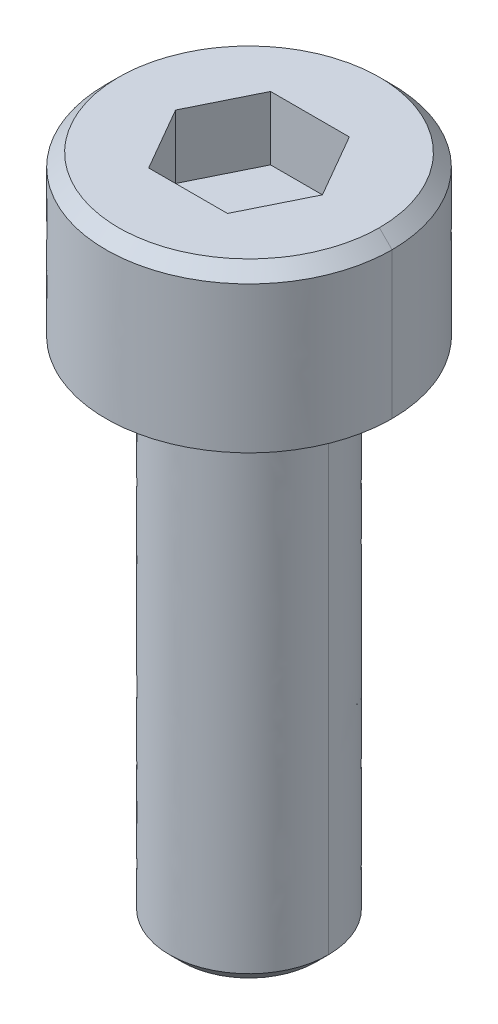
ISO-10303-21;
HEADER;
FILE_DESCRIPTION(('STEP AP214'),'2;1');
FILE_NAME('part.step','',(''),(''),'','','');
FILE_SCHEMA(('AUTOMOTIVE_DESIGN { 1 0 10303 214 1 1 1 1 }'));
ENDSEC;
DATA;
#1=APPLICATION_CONTEXT('core data for automotive mechanical design processes');
#2=APPLICATION_PROTOCOL_DEFINITION('international standard','automotive_design',2000,#1);
#3=PRODUCT_CONTEXT('',#1,'mechanical');
#4=PRODUCT('Part','Part','',(#3));
#5=PRODUCT_RELATED_PRODUCT_CATEGORY('part','',(#4));
#6=PRODUCT_DEFINITION_FORMATION('','',#4);
#7=PRODUCT_DEFINITION_CONTEXT('part definition',#1,'design');
#8=PRODUCT_DEFINITION('design','',#6,#7);
#9=PRODUCT_DEFINITION_SHAPE('','',#8);
#10=(LENGTH_UNIT() NAMED_UNIT(*) SI_UNIT(.MILLI.,.METRE.));
#11=(NAMED_UNIT(*) PLANE_ANGLE_UNIT() SI_UNIT($,.RADIAN.));
#12=(NAMED_UNIT(*) SI_UNIT($,.STERADIAN.) SOLID_ANGLE_UNIT());
#13=UNCERTAINTY_MEASURE_WITH_UNIT(LENGTH_MEASURE(1.E-05),#10,'distance_accuracy_value','');
#14=(GEOMETRIC_REPRESENTATION_CONTEXT(3) GLOBAL_UNCERTAINTY_ASSIGNED_CONTEXT((#13)) GLOBAL_UNIT_ASSIGNED_CONTEXT((#10,
#11,#12)) REPRESENTATION_CONTEXT('',''));
#15=CARTESIAN_POINT('',(0.,0.,0.));
#16=DIRECTION('',(0.,0.,1.));
#17=DIRECTION('',(1.,0.,0.));
#18=AXIS2_PLACEMENT_3D('',#15,#16,#17);
#19=CARTESIAN_POINT('',(-1.200888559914,9.5,1.04));
#20=DIRECTION('',(0.,1.,0.));
#21=DIRECTION('',(1.,0.,0.));
#22=AXIS2_PLACEMENT_3D('',#19,#20,#21);
#23=PLANE('',#22);
#24=DIRECTION('',(1.,0.,0.));
#25=VECTOR('',#24,1.);
#26=CARTESIAN_POINT('',(0.04209505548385,9.5,1.));
#27=LINE('',#26,#25);
#28=CARTESIAN_POINT('',(-0.577350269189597,9.5,0.999999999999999));
#29=VERTEX_POINT('',#28);
#30=CARTESIAN_POINT('',(0.661540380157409,9.5,1.));
#31=VERTEX_POINT('',#30);
#32=EDGE_CURVE('E123',#29,#31,#27,.T.);
#33=ORIENTED_EDGE('',*,*,#32,.T.);
#34=DIRECTION('',(0.442299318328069,0.,-0.896867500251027));
#35=VECTOR('',#34,1.);
#36=CARTESIAN_POINT('',(0.9081204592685,9.5,0.5));
#37=LINE('',#36,#35);
#38=CARTESIAN_POINT('',(1.15470053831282,9.5,1.34966672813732E-10));
#39=VERTEX_POINT('',#38);
#40=EDGE_CURVE('E132',#31,#39,#37,.T.);
#41=ORIENTED_EDGE('',*,*,#40,.T.);
#42=DIRECTION('',(-0.499999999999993,0.,-0.866025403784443));
#43=VECTOR('',#42,1.);
#44=CARTESIAN_POINT('',(0.8660254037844,9.5,-0.5));
#45=LINE('',#44,#43);
#46=CARTESIAN_POINT('',(0.577350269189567,9.5,-0.999999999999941));
#47=VERTEX_POINT('',#46);
#48=EDGE_CURVE('E131',#39,#47,#45,.T.);
#49=ORIENTED_EDGE('',*,*,#48,.T.);
#50=DIRECTION('',(-1.,0.,0.));
#51=VECTOR('',#50,1.);
#52=CARTESIAN_POINT('',(-0.04209505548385,9.5,-1.));
#53=LINE('',#52,#51);
#54=CARTESIAN_POINT('',(-0.661540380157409,9.5,-1.));
#55=VERTEX_POINT('',#54);
#56=EDGE_CURVE('E93',#47,#55,#53,.T.);
#57=ORIENTED_EDGE('',*,*,#56,.T.);
#58=DIRECTION('',(-0.442299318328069,0.,0.896867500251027));
#59=VECTOR('',#58,1.);
#60=CARTESIAN_POINT('',(-0.9081204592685,9.5,-0.5));
#61=LINE('',#60,#59);
#62=CARTESIAN_POINT('',(-1.15470053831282,9.5,-1.34966672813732E-10));
#63=VERTEX_POINT('',#62);
#64=EDGE_CURVE('E108',#55,#63,#61,.T.);
#65=ORIENTED_EDGE('',*,*,#64,.T.);
#66=DIRECTION('',(0.499999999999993,0.,0.866025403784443));
#67=VECTOR('',#66,1.);
#68=CARTESIAN_POINT('',(-0.8660254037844,9.5,0.5));
#69=LINE('',#68,#67);
#70=EDGE_CURVE('E106',#63,#29,#69,.T.);
#71=ORIENTED_EDGE('',*,*,#70,.T.);
#72=EDGE_LOOP('',(#33,#41,#49,#57,#65,#71));
#73=FACE_BOUND('',#72,.T.);
#74=ADVANCED_FACE('F17',(#73),#23,.T.);
#75=CARTESIAN_POINT('',(-0.651677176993,9.48,-1.02));
#76=DIRECTION('',(-0.896867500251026,0.,-0.442299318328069));
#77=DIRECTION('',(-0.442299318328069,0.,0.896867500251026));
#78=AXIS2_PLACEMENT_3D('',#75,#76,#77);
#79=PLANE('',#78);
#80=ORIENTED_EDGE('',*,*,#64,.F.);
#81=DIRECTION('',(0.,1.,0.));
#82=VECTOR('',#81,1.);
#83=CARTESIAN_POINT('',(-0.6615403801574,10.,-1.));
#84=LINE('',#83,#82);
#85=CARTESIAN_POINT('',(-0.661540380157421,10.5,-1.));
#86=VERTEX_POINT('',#85);
#87=EDGE_CURVE('E84',#55,#86,#84,.T.);
#88=ORIENTED_EDGE('',*,*,#87,.T.);
#89=DIRECTION('',(-0.442299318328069,0.,0.896867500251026));
#90=VECTOR('',#89,1.);
#91=CARTESIAN_POINT('',(-0.651677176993,10.5,-1.02));
#92=LINE('',#91,#90);
#93=CARTESIAN_POINT('',(-1.15470053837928,10.5,-1.18556660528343E-13));
#94=VERTEX_POINT('',#93);
#95=EDGE_CURVE('E24',#86,#94,#92,.T.);
#96=ORIENTED_EDGE('',*,*,#95,.T.);
#97=DIRECTION('',(0.,-1.,0.));
#98=VECTOR('',#97,1.);
#99=CARTESIAN_POINT('',(-1.15470053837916,10.,0.));
#100=LINE('',#99,#98);
#101=EDGE_CURVE('E110',#94,#63,#100,.T.);
#102=ORIENTED_EDGE('',*,*,#101,.T.);
#103=EDGE_LOOP('',(#80,#88,#96,#102));
#104=FACE_BOUND('',#103,.T.);
#105=ADVANCED_FACE('F113',(#104),#79,.F.);
#106=CARTESIAN_POINT('',(-1.166247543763,9.48,-0.02));
#107=DIRECTION('',(-0.866025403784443,0.,0.499999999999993));
#108=DIRECTION('',(0.499999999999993,0.,0.866025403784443));
#109=AXIS2_PLACEMENT_3D('',#106,#107,#108);
#110=PLANE('',#109);
#111=ORIENTED_EDGE('',*,*,#70,.F.);
#112=ORIENTED_EDGE('',*,*,#101,.F.);
#113=DIRECTION('',(0.499999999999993,0.,0.866025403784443));
#114=VECTOR('',#113,1.);
#115=CARTESIAN_POINT('',(-1.166247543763,10.5,-0.02));
#116=LINE('',#115,#114);
#117=CARTESIAN_POINT('',(-0.577350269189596,10.5,1.));
#118=VERTEX_POINT('',#117);
#119=EDGE_CURVE('E143',#94,#118,#116,.T.);
#120=ORIENTED_EDGE('',*,*,#119,.T.);
#121=DIRECTION('',(0.,-1.,0.));
#122=VECTOR('',#121,1.);
#123=CARTESIAN_POINT('',(-0.5773502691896,10.,1.));
#124=LINE('',#123,#122);
#125=EDGE_CURVE('E120',#118,#29,#124,.T.);
#126=ORIENTED_EDGE('',*,*,#125,.T.);
#127=EDGE_LOOP('',(#111,#112,#120,#126));
#128=FACE_BOUND('',#127,.T.);
#129=ADVANCED_FACE('F118',(#128),#110,.F.);
#130=CARTESIAN_POINT('',(-0.6021280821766,9.48,1.));
#131=DIRECTION('',(0.,0.,1.));
#132=DIRECTION('',(1.,0.,0.));
#133=AXIS2_PLACEMENT_3D('',#130,#131,#132);
#134=PLANE('',#133);
#135=ORIENTED_EDGE('',*,*,#32,.F.);
#136=ORIENTED_EDGE('',*,*,#125,.F.);
#137=DIRECTION('',(-1.,0.,0.));
#138=VECTOR('',#137,1.);
#139=CARTESIAN_POINT('',(0.,10.5,1.));
#140=LINE('',#139,#138);
#141=CARTESIAN_POINT('',(0.661540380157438,10.5,1.00000000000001));
#142=VERTEX_POINT('',#141);
#143=EDGE_CURVE('E140',#118,#142,#140,.F.);
#144=ORIENTED_EDGE('',*,*,#143,.T.);
#145=DIRECTION('',(0.,-1.,0.));
#146=VECTOR('',#145,1.);
#147=CARTESIAN_POINT('',(0.661540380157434,10.,1.00000000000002));
#148=LINE('',#147,#146);
#149=EDGE_CURVE('E144',#142,#31,#148,.T.);
#150=ORIENTED_EDGE('',*,*,#149,.T.);
#151=EDGE_LOOP('',(#135,#136,#144,#150));
#152=FACE_BOUND('',#151,.T.);
#153=ADVANCED_FACE('F273',(#152),#134,.F.);
#154=CARTESIAN_POINT('',(0.651677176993,9.48,1.02));
#155=DIRECTION('',(0.896867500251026,0.,0.442299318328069));
#156=DIRECTION('',(0.442299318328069,0.,-0.896867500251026));
#157=AXIS2_PLACEMENT_3D('',#154,#155,#156);
#158=PLANE('',#157);
#159=ORIENTED_EDGE('',*,*,#40,.F.);
#160=ORIENTED_EDGE('',*,*,#149,.F.);
#161=DIRECTION('',(0.442299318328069,0.,-0.896867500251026));
#162=VECTOR('',#161,1.);
#163=CARTESIAN_POINT('',(0.651677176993,10.5,1.02));
#164=LINE('',#163,#162);
#165=CARTESIAN_POINT('',(1.15470053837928,10.5,1.18556660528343E-13));
#166=VERTEX_POINT('',#165);
#167=EDGE_CURVE('E142',#142,#166,#164,.T.);
#168=ORIENTED_EDGE('',*,*,#167,.T.);
#169=DIRECTION('',(0.,-1.,0.));
#170=VECTOR('',#169,1.);
#171=CARTESIAN_POINT('',(1.15470053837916,10.,0.));
#172=LINE('',#171,#170);
#173=EDGE_CURVE('E128',#166,#39,#172,.T.);
#174=ORIENTED_EDGE('',*,*,#173,.T.);
#175=EDGE_LOOP('',(#159,#160,#168,#174));
#176=FACE_BOUND('',#175,.T.);
#177=ADVANCED_FACE('F282',(#176),#158,.F.);
#178=CARTESIAN_POINT('',(1.166247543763,9.48,0.02));
#179=DIRECTION('',(0.866025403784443,0.,-0.499999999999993));
#180=DIRECTION('',(-0.499999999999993,0.,-0.866025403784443));
#181=AXIS2_PLACEMENT_3D('',#178,#179,#180);
#182=PLANE('',#181);
#183=ORIENTED_EDGE('',*,*,#48,.F.);
#184=ORIENTED_EDGE('',*,*,#173,.F.);
#185=DIRECTION('',(-0.499999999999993,0.,-0.866025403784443));
#186=VECTOR('',#185,1.);
#187=CARTESIAN_POINT('',(1.166247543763,10.5,0.02));
#188=LINE('',#187,#186);
#189=CARTESIAN_POINT('',(0.577350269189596,10.5,-1.));
#190=VERTEX_POINT('',#189);
#191=EDGE_CURVE('E139',#166,#190,#188,.T.);
#192=ORIENTED_EDGE('',*,*,#191,.T.);
#193=DIRECTION('',(0.,-1.,0.));
#194=VECTOR('',#193,1.);
#195=CARTESIAN_POINT('',(0.5773502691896,10.,-1.));
#196=LINE('',#195,#194);
#197=EDGE_CURVE('E133',#190,#47,#196,.T.);
#198=ORIENTED_EDGE('',*,*,#197,.T.);
#199=EDGE_LOOP('',(#183,#184,#192,#198));
#200=FACE_BOUND('',#199,.T.);
#201=ADVANCED_FACE('F285',(#200),#182,.F.);
#202=CARTESIAN_POINT('',(0.6021280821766,9.48,-1.));
#203=DIRECTION('',(0.,0.,-1.));
#204=DIRECTION('',(-1.,0.,0.));
#205=AXIS2_PLACEMENT_3D('',#202,#203,#204);
#206=PLANE('',#205);
#207=ORIENTED_EDGE('',*,*,#56,.F.);
#208=ORIENTED_EDGE('',*,*,#197,.F.);
#209=DIRECTION('',(1.,0.,0.));
#210=VECTOR('',#209,1.);
#211=CARTESIAN_POINT('',(0.,10.5,-1.));
#212=LINE('',#211,#210);
#213=EDGE_CURVE('E136',#190,#86,#212,.F.);
#214=ORIENTED_EDGE('',*,*,#213,.T.);
#215=ORIENTED_EDGE('',*,*,#87,.F.);
#216=EDGE_LOOP('',(#207,#208,#214,#215));
#217=FACE_BOUND('',#216,.T.);
#218=ADVANCED_FACE('F447',(#217),#206,.F.);
#219=CARTESIAN_POINT('',(-2.132,10.5,2.134136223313));
#220=DIRECTION('',(0.,1.,0.));
#221=DIRECTION('',(1.,0.,0.));
#222=AXIS2_PLACEMENT_3D('',#219,#220,#221);
#223=PLANE('',#222);
#224=ORIENTED_EDGE('',*,*,#191,.F.);
#225=ORIENTED_EDGE('',*,*,#167,.F.);
#226=ORIENTED_EDGE('',*,*,#143,.F.);
#227=ORIENTED_EDGE('',*,*,#119,.F.);
#228=ORIENTED_EDGE('',*,*,#95,.F.);
#229=ORIENTED_EDGE('',*,*,#213,.F.);
#230=EDGE_LOOP('',(#224,#225,#226,#227,#228,#229));
#231=FACE_BOUND('',#230,.T.);
#232=CARTESIAN_POINT('',(2.04999658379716,10.5,-1.69925382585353E-10));
#233=CARTESIAN_POINT('',(2.04999888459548,10.5,-0.0530491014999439));
#234=CARTESIAN_POINT('',(2.04793926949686,10.5,-0.106076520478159));
#235=CARTESIAN_POINT('',(2.03971697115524,10.5,-0.211810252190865));
#236=CARTESIAN_POINT('',(2.03355444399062,10.5,-0.264516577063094));
#237=CARTESIAN_POINT('',(2.00896726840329,10.5,-0.421590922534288));
#238=CARTESIAN_POINT('',(1.98444289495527,10.5,-0.525070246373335));
#239=CARTESIAN_POINT('',(1.91969834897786,10.5,-0.72698394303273));
#240=CARTESIAN_POINT('',(1.8794734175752,10.5,-0.825416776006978));
#241=CARTESIAN_POINT('',(1.78429484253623,10.5,-1.01490109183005));
#242=CARTESIAN_POINT('',(1.7293395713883,10.5,-1.10595175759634));
#243=CARTESIAN_POINT('',(1.60064649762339,10.5,-1.28596251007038));
#244=CARTESIAN_POINT('',(1.52569338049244,10.5,-1.37405699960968));
#245=CARTESIAN_POINT('',(1.36204270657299,10.5,-1.53643290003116));
#246=CARTESIAN_POINT('',(1.27334080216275,10.5,-1.61070992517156));
#247=CARTESIAN_POINT('',(1.08473287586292,10.5,-1.74331056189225));
#248=CARTESIAN_POINT('',(0.984828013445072,10.5,-1.8016358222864));
#249=CARTESIAN_POINT('',(0.776653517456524,10.5,-1.90067990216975));
#250=CARTESIAN_POINT('',(0.668384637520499,10.5,-1.94140030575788));
#251=CARTESIAN_POINT('',(0.446543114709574,10.5,-2.00408946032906));
#252=CARTESIAN_POINT('',(0.332970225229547,10.5,-2.0260573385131));
#253=CARTESIAN_POINT('',(0.103741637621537,10.5,-2.05061179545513));
#254=CARTESIAN_POINT('',(-0.011914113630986,10.5,-2.05319787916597));
#255=CARTESIAN_POINT('',(-0.242004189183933,10.5,-2.03892502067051));
#256=CARTESIAN_POINT('',(-0.356438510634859,10.5,-2.02206603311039));
#257=CARTESIAN_POINT('',(-0.580904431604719,10.5,-1.96934089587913));
#258=CARTESIAN_POINT('',(-0.690936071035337,10.5,-1.93347491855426));
#259=CARTESIAN_POINT('',(-0.850201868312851,10.5,-1.86627578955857));
#260=CARTESIAN_POINT('',(-0.902352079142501,10.5,-1.84162665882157));
#261=CARTESIAN_POINT('',(-1.00439022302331,10.5,-1.78801965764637));
#262=CARTESIAN_POINT('',(-1.05427867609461,10.5,-1.75906278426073));
#263=CARTESIAN_POINT('',(-1.15142262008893,10.5,-1.69706500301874));
#264=CARTESIAN_POINT('',(-1.19867910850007,10.5,-1.66402565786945));
#265=CARTESIAN_POINT('',(-1.29027470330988,10.5,-1.59405796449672));
#266=CARTESIAN_POINT('',(-1.33461095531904,10.5,-1.55712590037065));
#267=CARTESIAN_POINT('',(-1.46265099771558,10.5,-1.44096337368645));
#268=CARTESIAN_POINT('',(-1.54151847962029,10.5,-1.35628187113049));
#269=CARTESIAN_POINT('',(-1.68388694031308,10.5,-1.17486372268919));
#270=CARTESIAN_POINT('',(-1.74738834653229,10.5,-1.07812741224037));
#271=CARTESIAN_POINT('',(-1.8297897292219,10.5,-0.926120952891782));
#272=CARTESIAN_POINT('',(-1.85513237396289,10.5,-0.874251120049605));
#273=CARTESIAN_POINT('',(-1.90133741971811,10.5,-0.76859024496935));
#274=CARTESIAN_POINT('',(-1.92220361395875,10.5,-0.714800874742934));
#275=CARTESIAN_POINT('',(-1.95932343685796,10.5,-0.605687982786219));
#276=CARTESIAN_POINT('',(-1.97557939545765,10.5,-0.550365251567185));
#277=CARTESIAN_POINT('',(-2.00336862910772,10.5,-0.438553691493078));
#278=CARTESIAN_POINT('',(-2.01490266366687,10.5,-0.382065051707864));
#279=CARTESIAN_POINT('',(-2.03268129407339,10.5,-0.271403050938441));
#280=CARTESIAN_POINT('',(-2.03917867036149,10.5,-0.217270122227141));
#281=CARTESIAN_POINT('',(-2.04783648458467,10.5,-0.108758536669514));
#282=CARTESIAN_POINT('',(-2.05000484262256,10.5,-0.0543805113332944));
#283=CARTESIAN_POINT('',(-2.0499965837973,10.5,2.64202289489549E-10));
#284=B_SPLINE_CURVE_WITH_KNOTS('',3,(#232,#233,#234,#235,#236,#237,#238,#239,#240,#241,#242,
#243,#244,#245,#246,#247,#248,#249,#250,#251,#252,#253,#254,#255,#256,#257,#258,#259,#260,#261,
#262,#263,#264,#265,#266,#267,#268,#269,#270,#271,#272,#273,#274,#275,#276,#277,#278,#279,#280,
#281,#282,#283),.UNSPECIFIED.,.F.,.F.,(4,2,2,2,2,2,2,2,2,2,2,2,2,2,2,2,2,2,2,2,2,2,2,2,2,4),(0.,
0.159064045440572,0.318122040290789,0.63577528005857,0.95352487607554,1.271309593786,
1.61664493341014,1.96208969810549,2.3074987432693,2.65287670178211,2.99827073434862,
3.34367358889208,3.68907724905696,4.03447777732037,4.20735518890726,4.38019264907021,
4.55296415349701,4.72590210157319,5.07131245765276,5.41671320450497,5.58973080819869,
5.76260121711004,5.93538410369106,6.10813918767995,6.27153198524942,6.43462557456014),.UNSPECIFIED.);
#285=CARTESIAN_POINT('',(2.04999658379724,10.5,-2.17482759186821E-10));
#286=VERTEX_POINT('',#285);
#287=CARTESIAN_POINT('',(-2.04999658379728,10.5,3.12639094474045E-10));
#288=VERTEX_POINT('',#287);
#289=EDGE_CURVE('E138',#286,#288,#284,.T.);
#290=ORIENTED_EDGE('',*,*,#289,.T.);
#291=CARTESIAN_POINT('',(-2.04999658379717,10.5,1.69088338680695E-10));
#292=CARTESIAN_POINT('',(-2.04999888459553,10.5,0.0530491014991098));
#293=CARTESIAN_POINT('',(-2.04793926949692,10.5,0.106076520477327));
#294=CARTESIAN_POINT('',(-2.03971697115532,10.5,0.211810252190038));
#295=CARTESIAN_POINT('',(-2.03355444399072,10.5,0.264516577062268));
#296=CARTESIAN_POINT('',(-2.00896726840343,10.5,0.421590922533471));
#297=CARTESIAN_POINT('',(-1.98444289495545,10.5,0.525070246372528));
#298=CARTESIAN_POINT('',(-1.91969834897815,10.5,0.726983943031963));
#299=CARTESIAN_POINT('',(-1.87947341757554,10.5,0.825416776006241));
#300=CARTESIAN_POINT('',(-1.78429484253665,10.5,1.01490109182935));
#301=CARTESIAN_POINT('',(-1.72933957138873,10.5,1.10595175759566));
#302=CARTESIAN_POINT('',(-1.60064649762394,10.5,1.28596251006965));
#303=CARTESIAN_POINT('',(-1.52569338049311,10.5,1.37405699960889));
#304=CARTESIAN_POINT('',(-1.36204270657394,10.5,1.53643290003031));
#305=CARTESIAN_POINT('',(-1.27334080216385,10.5,1.61070992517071));
#306=CARTESIAN_POINT('',(-1.08473287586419,10.5,1.74331056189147));
#307=CARTESIAN_POINT('',(-0.984828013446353,10.5,1.80163582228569));
#308=CARTESIAN_POINT('',(-0.776653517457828,10.5,1.9006799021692));
#309=CARTESIAN_POINT('',(-0.668384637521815,10.5,1.94140030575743));
#310=CARTESIAN_POINT('',(-0.446543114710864,10.5,2.00408946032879));
#311=CARTESIAN_POINT('',(-0.332970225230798,10.5,2.02605733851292));
#312=CARTESIAN_POINT('',(-0.103741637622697,10.5,2.05061179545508));
#313=CARTESIAN_POINT('',(0.0119141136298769,10.5,2.05319787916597));
#314=CARTESIAN_POINT('',(0.24200418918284,10.5,2.03892502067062));
#315=CARTESIAN_POINT('',(0.356438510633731,10.5,2.0220660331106));
#316=CARTESIAN_POINT('',(0.58090443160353,10.5,1.96934089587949));
#317=CARTESIAN_POINT('',(0.690936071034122,10.5,1.9334749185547));
#318=CARTESIAN_POINT('',(0.850201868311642,10.5,1.86627578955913));
#319=CARTESIAN_POINT('',(0.902352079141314,10.5,1.84162665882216));
#320=CARTESIAN_POINT('',(1.00439022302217,10.5,1.78801965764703));
#321=CARTESIAN_POINT('',(1.05427867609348,10.5,1.75906278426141));
#322=CARTESIAN_POINT('',(1.15142262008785,10.5,1.69706500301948));
#323=CARTESIAN_POINT('',(1.19867910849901,10.5,1.66402565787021));
#324=CARTESIAN_POINT('',(1.29027470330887,10.5,1.59405796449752));
#325=CARTESIAN_POINT('',(1.33461095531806,10.5,1.55712590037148));
#326=CARTESIAN_POINT('',(1.46265099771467,10.5,1.44096337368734));
#327=CARTESIAN_POINT('',(1.54151847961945,10.5,1.35628187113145));
#328=CARTESIAN_POINT('',(1.68388694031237,10.5,1.17486372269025));
#329=CARTESIAN_POINT('',(1.74738834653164,10.5,1.07812741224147));
#330=CARTESIAN_POINT('',(1.82978972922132,10.5,0.926120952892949));
#331=CARTESIAN_POINT('',(1.85513237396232,10.5,0.874251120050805));
#332=CARTESIAN_POINT('',(1.90133741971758,10.5,0.768590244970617));
#333=CARTESIAN_POINT('',(1.92220361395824,10.5,0.714800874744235));
#334=CARTESIAN_POINT('',(1.9593234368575,10.5,0.605687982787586));
#335=CARTESIAN_POINT('',(1.97557939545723,10.5,0.550365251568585));
#336=CARTESIAN_POINT('',(2.00336862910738,10.5,0.438553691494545));
#337=CARTESIAN_POINT('',(2.01490266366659,10.5,0.382065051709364));
#338=CARTESIAN_POINT('',(2.03268129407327,10.5,0.271403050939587));
#339=CARTESIAN_POINT('',(2.03917867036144,10.5,0.217270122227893));
#340=CARTESIAN_POINT('',(2.0478364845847,10.5,0.108758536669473));
#341=CARTESIAN_POINT('',(2.05000484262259,10.5,0.0543805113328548));
#342=CARTESIAN_POINT('',(2.04999658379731,10.5,-2.65038310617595E-10));
#343=B_SPLINE_CURVE_WITH_KNOTS('',3,(#291,#292,#293,#294,#295,#296,#297,#298,#299,#300,#301,
#302,#303,#304,#305,#306,#307,#308,#309,#310,#311,#312,#313,#314,#315,#316,#317,#318,#319,#320,
#321,#322,#323,#324,#325,#326,#327,#328,#329,#330,#331,#332,#333,#334,#335,#336,#337,#338,#339,
#340,#341,#342),.UNSPECIFIED.,.F.,.F.,(4,2,2,2,2,2,2,2,2,2,2,2,2,2,2,2,2,2,2,2,2,2,2,2,2,4),(0.,
0.159064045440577,0.318122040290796,0.635775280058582,0.953524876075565,1.27130959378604,
1.61664493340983,1.96208969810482,2.3074987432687,2.65287670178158,2.99827073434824,
3.34367358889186,3.6890772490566,4.03447777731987,4.20735518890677,4.38019264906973,
4.55296415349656,4.72590210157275,5.07131245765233,5.41671320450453,5.58973080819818,
5.76260121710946,5.93538410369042,6.10813918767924,6.27153198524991,6.43462557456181),.UNSPECIFIED.);
#344=EDGE_CURVE('E227',#288,#286,#343,.T.);
#345=ORIENTED_EDGE('',*,*,#344,.T.);
#346=EDGE_LOOP('',(#290,#345));
#347=FACE_BOUND('',#346,.T.);
#348=ADVANCED_FACE('F256',(#231,#347),#223,.T.);
#349=CARTESIAN_POINT('',(-2.035557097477,10.51041825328,0.128066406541));
#350=CARTESIAN_POINT('',(-2.109024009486,10.43680608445,0.1326885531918));
#351=CARTESIAN_POINT('',(-2.182490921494,10.36319391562,0.1373106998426));
#352=CARTESIAN_POINT('',(-2.255957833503,10.28958174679,0.1419328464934));
#353=CARTESIAN_POINT('',(-2.042530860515,10.51041825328,0.01722162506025));
#354=CARTESIAN_POINT('',(-2.116249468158,10.43680608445,0.01784318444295));
#355=CARTESIAN_POINT('',(-2.189968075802,10.36319391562,0.01846474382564));
#356=CARTESIAN_POINT('',(-2.263686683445,10.28958174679,0.01908630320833));
#357=CARTESIAN_POINT('',(-2.038330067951,10.51041825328,-0.2056082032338));
#358=CARTESIAN_POINT('',(-2.111897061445,10.43680608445,-0.2130289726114));
#359=CARTESIAN_POINT('',(-2.185464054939,10.36319391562,-0.2204497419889));
#360=CARTESIAN_POINT('',(-2.259031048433,10.28958174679,-0.2278705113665));
#361=CARTESIAN_POINT('',(-1.97775207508,10.51041825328,-0.5343792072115));
#362=CARTESIAN_POINT('',(-2.049132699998,10.43680608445,-0.5536659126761));
#363=CARTESIAN_POINT('',(-2.120513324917,10.36319391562,-0.5729526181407));
#364=CARTESIAN_POINT('',(-2.191893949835,10.28958174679,-0.5922393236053));
#365=CARTESIAN_POINT('',(-1.864510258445,10.51041825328,-0.8489203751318));
#366=CARTESIAN_POINT('',(-1.931803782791,10.43680608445,-0.8795594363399));
#367=CARTESIAN_POINT('',(-1.999097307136,10.36319391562,-0.910198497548));
#368=CARTESIAN_POINT('',(-2.066390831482,10.28958174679,-0.9408375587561));
#369=CARTESIAN_POINT('',(-1.701620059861,10.51041825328,-1.140856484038));
#370=CARTESIAN_POINT('',(-1.763034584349,10.43680608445,-1.182032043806));
#371=CARTESIAN_POINT('',(-1.824449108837,10.36319391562,-1.223207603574));
#372=CARTESIAN_POINT('',(-1.885863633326,10.28958174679,-1.264383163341));
#373=CARTESIAN_POINT('',(-1.493418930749,10.51041825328,-1.402413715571));
#374=CARTESIAN_POINT('',(-1.547319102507,10.43680608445,-1.453029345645));
#375=CARTESIAN_POINT('',(-1.601219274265,10.36319391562,-1.50364497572));
#376=CARTESIAN_POINT('',(-1.655119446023,10.28958174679,-1.554260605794));
#377=CARTESIAN_POINT('',(-1.245450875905,10.51041825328,-1.6266273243));
#378=CARTESIAN_POINT('',(-1.290401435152,10.43680608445,-1.685335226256));
#379=CARTESIAN_POINT('',(-1.3353519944,10.36319391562,-1.744043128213));
#380=CARTESIAN_POINT('',(-1.380302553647,10.28958174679,-1.802751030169));
#381=CARTESIAN_POINT('',(-0.9643188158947,10.51041825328,-1.807526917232));
#382=CARTESIAN_POINT('',(-0.9991228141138,10.43680608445,-1.872763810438));
#383=CARTESIAN_POINT('',(-1.033926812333,10.36319391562,-1.938000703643));
#384=CARTESIAN_POINT('',(-1.068730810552,10.28958174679,-2.003237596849));
#385=CARTESIAN_POINT('',(-0.6575087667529,10.51041825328,-1.940295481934));
#386=CARTESIAN_POINT('',(-0.6812394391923,10.43680608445,-2.010324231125));
#387=CARTESIAN_POINT('',(-0.7049701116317,10.36319391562,-2.080352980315));
#388=CARTESIAN_POINT('',(-0.7287007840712,10.28958174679,-2.150381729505));
#389=CARTESIAN_POINT('',(-0.3331905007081,10.51041825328,-2.021397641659));
#390=CARTESIAN_POINT('',(-0.3452159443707,10.43680608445,-2.094353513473));
#391=CARTESIAN_POINT('',(-0.3572413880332,10.36319391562,-2.167309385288));
#392=CARTESIAN_POINT('',(-0.3692668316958,10.28958174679,-2.240265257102));
#393=CARTESIAN_POINT('',(-7.895575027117E-10,10.51041825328,-2.048673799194));
#394=CARTESIAN_POINT('',(-8.180540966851E-10,10.43680608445,-2.122614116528));
#395=CARTESIAN_POINT('',(-8.465506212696E-10,10.36319391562,-2.196554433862));
#396=CARTESIAN_POINT('',(-8.750471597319E-10,10.28958174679,-2.270494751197));
#397=CARTESIAN_POINT('',(0.33319049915,10.51041825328,-2.021397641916));
#398=CARTESIAN_POINT('',(0.3452159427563,10.43680608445,-2.094353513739));
#399=CARTESIAN_POINT('',(0.3572413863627,10.36319391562,-2.167309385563));
#400=CARTESIAN_POINT('',(0.369266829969,10.28958174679,-2.240265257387));
#401=CARTESIAN_POINT('',(0.6575087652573,10.51041825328,-1.940295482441));
#402=CARTESIAN_POINT('',(0.6812394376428,10.43680608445,-2.01032423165));
#403=CARTESIAN_POINT('',(0.7049701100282,10.36319391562,-2.080352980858));
#404=CARTESIAN_POINT('',(0.7287007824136,10.28958174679,-2.150381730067));
#405=CARTESIAN_POINT('',(0.9643188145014,10.51041825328,-1.807526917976));
#406=CARTESIAN_POINT('',(0.9991228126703,10.43680608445,-1.872763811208));
#407=CARTESIAN_POINT('',(1.033926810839,10.36319391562,-1.93800070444));
#408=CARTESIAN_POINT('',(1.068730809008,10.28958174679,-2.003237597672));
#409=CARTESIAN_POINT('',(1.245450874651,10.51041825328,-1.62662732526));
#410=CARTESIAN_POINT('',(1.290401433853,10.43680608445,-1.685335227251));
#411=CARTESIAN_POINT('',(1.335351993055,10.36319391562,-1.744043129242));
#412=CARTESIAN_POINT('',(1.380302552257,10.28958174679,-1.802751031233));
#413=CARTESIAN_POINT('',(1.493418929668,10.51041825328,-1.402413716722));
#414=CARTESIAN_POINT('',(1.547319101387,10.43680608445,-1.453029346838));
#415=CARTESIAN_POINT('',(1.601219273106,10.36319391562,-1.503644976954));
#416=CARTESIAN_POINT('',(1.655119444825,10.28958174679,-1.55426060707));
#417=CARTESIAN_POINT('',(1.701620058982,10.51041825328,-1.14085648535));
#418=CARTESIAN_POINT('',(1.763034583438,10.43680608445,-1.182032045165));
#419=CARTESIAN_POINT('',(1.824449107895,10.36319391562,-1.22320760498));
#420=CARTESIAN_POINT('',(1.885863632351,10.28958174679,-1.264383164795));
#421=CARTESIAN_POINT('',(1.86451025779,10.51041825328,-0.848920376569));
#422=CARTESIAN_POINT('',(1.931803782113,10.43680608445,-0.8795594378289));
#423=CARTESIAN_POINT('',(1.999097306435,10.36319391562,-0.9101984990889));
#424=CARTESIAN_POINT('',(2.066390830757,10.28958174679,-0.9408375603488));
#425=CARTESIAN_POINT('',(1.977752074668,10.51041825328,-0.5343792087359));
#426=CARTESIAN_POINT('',(2.049132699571,10.43680608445,-0.5536659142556));
#427=CARTESIAN_POINT('',(2.120513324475,10.36319391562,-0.5729526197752));
#428=CARTESIAN_POINT('',(2.191893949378,10.28958174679,-0.5922393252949));
#429=CARTESIAN_POINT('',(2.038330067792,10.51041825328,-0.205608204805));
#430=CARTESIAN_POINT('',(2.11189706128,10.43680608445,-0.2130289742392));
#431=CARTESIAN_POINT('',(2.185464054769,10.36319391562,-0.2204497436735));
#432=CARTESIAN_POINT('',(2.259031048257,10.28958174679,-0.2278705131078));
#433=CARTESIAN_POINT('',(2.042530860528,10.51041825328,0.01722162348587));
#434=CARTESIAN_POINT('',(2.116249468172,10.43680608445,0.01784318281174));
#435=CARTESIAN_POINT('',(2.189968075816,10.36319391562,0.01846474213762));
#436=CARTESIAN_POINT('',(2.26368668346,10.28958174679,0.01908630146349));
#437=CARTESIAN_POINT('',(2.035557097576,10.51041825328,0.128066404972));
#438=CARTESIAN_POINT('',(2.109024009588,10.43680608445,0.1326885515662));
#439=CARTESIAN_POINT('',(2.1824909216,10.36319391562,0.1373106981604));
#440=CARTESIAN_POINT('',(2.255957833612,10.28958174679,0.1419328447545));
#441=B_SPLINE_SURFACE_WITH_KNOTS('',3,3,((#349,#350,#351,#352),(#353,#354,#355,#356),(#357,#358,
#359,#360),(#361,#362,#363,#364),(#365,#366,#367,#368),(#369,#370,#371,#372),(#373,#374,#375,
#376),(#377,#378,#379,#380),(#381,#382,#383,#384),(#385,#386,#387,#388),(#389,#390,#391,#392),
(#393,#394,#395,#396),(#397,#398,#399,#400),(#401,#402,#403,#404),(#405,#406,#407,#408),(#409,
#410,#411,#412),(#413,#414,#415,#416),(#417,#418,#419,#420),(#421,#422,#423,#424),(#425,#426,
#427,#428),(#429,#430,#431,#432),(#433,#434,#435,#436),(#437,#438,#439,#440)),.UNSPECIFIED.,.F.,
.F.,.F.,(4,1,1,1,1,1,1,1,1,1,1,1,1,1,1,1,1,1,1,1,4),(4,4),(-1.633628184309,-1.470265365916,
-1.306902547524,-1.143539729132,-0.9801769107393,-0.816814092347,-0.6534512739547,
-0.4900884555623,-0.32672563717,-0.1633628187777,-3.853993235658E-10,0.1633628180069,
0.3267256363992,0.4900884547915,0.6534512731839,0.8168140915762,0.9801769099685,1.143539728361,
1.306902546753,1.470265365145,1.633628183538),(2.039581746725,2.260418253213),.UNSPECIFIED.);
#442=CARTESIAN_POINT('',(2.245560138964,10.3,0.141278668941));
#443=CARTESIAN_POINT('',(2.253253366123,10.3,0.01899832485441));
#444=CARTESIAN_POINT('',(2.248619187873,10.3,-0.2268202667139));
#445=CARTESIAN_POINT('',(2.181791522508,10.3,-0.5895097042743));
#446=CARTESIAN_POINT('',(2.056866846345,10.3,-0.9365012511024));
#447=CARTESIAN_POINT('',(1.877171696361,10.3,-1.258555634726));
#448=CARTESIAN_POINT('',(1.647491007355,10.3,-1.547097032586));
#449=CARTESIAN_POINT('',(1.373940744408,10.3,-1.794442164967));
#450=CARTESIAN_POINT('',(1.063805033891,10.3,-1.99400468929));
#451=CARTESIAN_POINT('',(0.7253422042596,10.3,-2.140470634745));
#452=CARTESIAN_POINT('',(0.3675648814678,10.3,-2.22993988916));
#453=CARTESIAN_POINT('',(0.,10.3,-2.26003005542));
#454=CARTESIAN_POINT('',(-0.3675648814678,10.3,-2.22993988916));
#455=CARTESIAN_POINT('',(-0.7253422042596,10.3,-2.140470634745));
#456=CARTESIAN_POINT('',(-1.063805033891,10.3,-1.99400468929));
#457=CARTESIAN_POINT('',(-1.373940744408,10.3,-1.794442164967));
#458=CARTESIAN_POINT('',(-1.647491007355,10.3,-1.547097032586));
#459=CARTESIAN_POINT('',(-1.877171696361,10.3,-1.258555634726));
#460=CARTESIAN_POINT('',(-2.056866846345,10.3,-0.9365012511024));
#461=CARTESIAN_POINT('',(-2.181791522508,10.3,-0.5895097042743));
#462=CARTESIAN_POINT('',(-2.248619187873,10.3,-0.2268202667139));
#463=CARTESIAN_POINT('',(-2.253253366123,10.3,0.01899832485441));
#464=CARTESIAN_POINT('',(-2.245560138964,10.3,0.141278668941));
#465=B_SPLINE_CURVE_WITH_KNOTS('',3,(#442,#443,#444,#445,#446,#447,#448,#449,#450,#451,#452,
#453,#454,#455,#456,#457,#458,#459,#460,#461,#462,#463,#464),.UNSPECIFIED.,.F.,.F.,(4,1,1,1,1,1,
1,1,1,1,1,1,1,1,1,1,1,1,1,1,4),(-0.0628318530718,0.1005309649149,0.2638937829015,
0.4272566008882,0.5906194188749,0.7539822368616,0.9173450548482,1.080707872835,1.244070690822,
1.407433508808,1.570796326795,1.734159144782,1.897521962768,2.060884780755,2.224247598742,
2.387610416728,2.550973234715,2.714336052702,2.877698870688,3.041061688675,3.204424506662),.UNSPECIFIED.);
#466=CARTESIAN_POINT('',(2.24999671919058,10.2999995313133,-3.89270226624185E-10));
#467=VERTEX_POINT('',#466);
#468=CARTESIAN_POINT('',(-2.24999671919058,10.2999995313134,4.313930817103E-11));
#469=VERTEX_POINT('',#468);
#470=EDGE_CURVE('E300',#467,#469,#465,.T.);
#471=DIRECTION('',(-0.707106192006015,-0.707107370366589,1.24383070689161E-10));
#472=VECTOR('',#471,1.);
#473=CARTESIAN_POINT('',(-2.14999641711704,10.400000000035,3.78666307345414E-10));
#474=LINE('',#473,#472);
#475=EDGE_CURVE('E295',#469,#288,#474,.F.);
#476=DIRECTION('',(-0.707106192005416,0.707107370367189,1.93312775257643E-10));
#477=VECTOR('',#476,1.);
#478=CARTESIAN_POINT('',(2.14999641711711,10.400000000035,-5.88029794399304E-10));
#479=LINE('',#478,#477);
#480=EDGE_CURVE('E292',#286,#467,#479,.F.);
#481=ORIENTED_EDGE('',*,*,#470,.T.);
#482=ORIENTED_EDGE('',*,*,#475,.T.);
#483=ORIENTED_EDGE('',*,*,#289,.F.);
#484=ORIENTED_EDGE('',*,*,#480,.T.);
#485=EDGE_LOOP('',(#481,#482,#483,#484));
#486=FACE_BOUND('',#485,.T.);
#487=ADVANCED_FACE('F245',(#486),#441,.T.);
#488=CARTESIAN_POINT('',(2.035557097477,10.51041825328,-0.128066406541));
#489=CARTESIAN_POINT('',(2.109024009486,10.43680608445,-0.1326885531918));
#490=CARTESIAN_POINT('',(2.182490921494,10.36319391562,-0.1373106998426));
#491=CARTESIAN_POINT('',(2.255957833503,10.28958174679,-0.1419328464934));
#492=CARTESIAN_POINT('',(2.042530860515,10.51041825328,-0.01722162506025));
#493=CARTESIAN_POINT('',(2.116249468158,10.43680608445,-0.01784318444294));
#494=CARTESIAN_POINT('',(2.189968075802,10.36319391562,-0.01846474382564));
#495=CARTESIAN_POINT('',(2.263686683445,10.28958174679,-0.01908630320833));
#496=CARTESIAN_POINT('',(2.038330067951,10.51041825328,0.2056082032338));
#497=CARTESIAN_POINT('',(2.111897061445,10.43680608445,0.2130289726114));
#498=CARTESIAN_POINT('',(2.185464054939,10.36319391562,0.2204497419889));
#499=CARTESIAN_POINT('',(2.259031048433,10.28958174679,0.2278705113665));
#500=CARTESIAN_POINT('',(1.97775207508,10.51041825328,0.5343792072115));
#501=CARTESIAN_POINT('',(2.049132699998,10.43680608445,0.5536659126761));
#502=CARTESIAN_POINT('',(2.120513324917,10.36319391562,0.5729526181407));
#503=CARTESIAN_POINT('',(2.191893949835,10.28958174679,0.5922393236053));
#504=CARTESIAN_POINT('',(1.864510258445,10.51041825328,0.8489203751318));
#505=CARTESIAN_POINT('',(1.931803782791,10.43680608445,0.8795594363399));
#506=CARTESIAN_POINT('',(1.999097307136,10.36319391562,0.910198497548));
#507=CARTESIAN_POINT('',(2.066390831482,10.28958174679,0.9408375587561));
#508=CARTESIAN_POINT('',(1.701620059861,10.51041825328,1.140856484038));
#509=CARTESIAN_POINT('',(1.763034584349,10.43680608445,1.182032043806));
#510=CARTESIAN_POINT('',(1.824449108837,10.36319391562,1.223207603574));
#511=CARTESIAN_POINT('',(1.885863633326,10.28958174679,1.264383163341));
#512=CARTESIAN_POINT('',(1.493418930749,10.51041825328,1.402413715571));
#513=CARTESIAN_POINT('',(1.547319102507,10.43680608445,1.453029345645));
#514=CARTESIAN_POINT('',(1.601219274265,10.36319391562,1.50364497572));
#515=CARTESIAN_POINT('',(1.655119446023,10.28958174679,1.554260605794));
#516=CARTESIAN_POINT('',(1.245450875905,10.51041825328,1.6266273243));
#517=CARTESIAN_POINT('',(1.290401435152,10.43680608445,1.685335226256));
#518=CARTESIAN_POINT('',(1.3353519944,10.36319391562,1.744043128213));
#519=CARTESIAN_POINT('',(1.380302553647,10.28958174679,1.802751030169));
#520=CARTESIAN_POINT('',(0.9643188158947,10.51041825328,1.807526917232));
#521=CARTESIAN_POINT('',(0.9991228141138,10.43680608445,1.872763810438));
#522=CARTESIAN_POINT('',(1.033926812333,10.36319391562,1.938000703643));
#523=CARTESIAN_POINT('',(1.068730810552,10.28958174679,2.003237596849));
#524=CARTESIAN_POINT('',(0.6575087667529,10.51041825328,1.940295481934));
#525=CARTESIAN_POINT('',(0.6812394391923,10.43680608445,2.010324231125));
#526=CARTESIAN_POINT('',(0.7049701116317,10.36319391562,2.080352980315));
#527=CARTESIAN_POINT('',(0.7287007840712,10.28958174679,2.150381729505));
#528=CARTESIAN_POINT('',(0.3331905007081,10.51041825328,2.021397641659));
#529=CARTESIAN_POINT('',(0.3452159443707,10.43680608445,2.094353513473));
#530=CARTESIAN_POINT('',(0.3572413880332,10.36319391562,2.167309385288));
#531=CARTESIAN_POINT('',(0.3692668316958,10.28958174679,2.240265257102));
#532=CARTESIAN_POINT('',(7.895589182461E-10,10.51041825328,2.048673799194));
#533=CARTESIAN_POINT('',(8.180555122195E-10,10.43680608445,2.122614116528));
#534=CARTESIAN_POINT('',(8.46552161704E-10,10.36319391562,2.196554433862));
#535=CARTESIAN_POINT('',(8.750487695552E-10,10.28958174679,2.270494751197));
#536=CARTESIAN_POINT('',(-0.33319049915,10.51041825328,2.021397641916));
#537=CARTESIAN_POINT('',(-0.3452159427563,10.43680608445,2.094353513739));
#538=CARTESIAN_POINT('',(-0.3572413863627,10.36319391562,2.167309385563));
#539=CARTESIAN_POINT('',(-0.369266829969,10.28958174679,2.240265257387));
#540=CARTESIAN_POINT('',(-0.6575087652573,10.51041825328,1.940295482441));
#541=CARTESIAN_POINT('',(-0.6812394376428,10.43680608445,2.01032423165));
#542=CARTESIAN_POINT('',(-0.7049701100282,10.36319391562,2.080352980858));
#543=CARTESIAN_POINT('',(-0.7287007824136,10.28958174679,2.150381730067));
#544=CARTESIAN_POINT('',(-0.9643188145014,10.51041825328,1.807526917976));
#545=CARTESIAN_POINT('',(-0.9991228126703,10.43680608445,1.872763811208));
#546=CARTESIAN_POINT('',(-1.033926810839,10.36319391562,1.93800070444));
#547=CARTESIAN_POINT('',(-1.068730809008,10.28958174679,2.003237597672));
#548=CARTESIAN_POINT('',(-1.245450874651,10.51041825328,1.62662732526));
#549=CARTESIAN_POINT('',(-1.290401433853,10.43680608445,1.685335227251));
#550=CARTESIAN_POINT('',(-1.335351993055,10.36319391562,1.744043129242));
#551=CARTESIAN_POINT('',(-1.380302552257,10.28958174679,1.802751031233));
#552=CARTESIAN_POINT('',(-1.493418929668,10.51041825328,1.402413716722));
#553=CARTESIAN_POINT('',(-1.547319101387,10.43680608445,1.453029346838));
#554=CARTESIAN_POINT('',(-1.601219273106,10.36319391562,1.503644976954));
#555=CARTESIAN_POINT('',(-1.655119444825,10.28958174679,1.55426060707));
#556=CARTESIAN_POINT('',(-1.701620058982,10.51041825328,1.14085648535));
#557=CARTESIAN_POINT('',(-1.763034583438,10.43680608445,1.182032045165));
#558=CARTESIAN_POINT('',(-1.824449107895,10.36319391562,1.22320760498));
#559=CARTESIAN_POINT('',(-1.885863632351,10.28958174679,1.264383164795));
#560=CARTESIAN_POINT('',(-1.86451025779,10.51041825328,0.848920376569));
#561=CARTESIAN_POINT('',(-1.931803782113,10.43680608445,0.8795594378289));
#562=CARTESIAN_POINT('',(-1.999097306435,10.36319391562,0.9101984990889));
#563=CARTESIAN_POINT('',(-2.066390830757,10.28958174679,0.9408375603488));
#564=CARTESIAN_POINT('',(-1.977752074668,10.51041825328,0.5343792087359));
#565=CARTESIAN_POINT('',(-2.049132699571,10.43680608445,0.5536659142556));
#566=CARTESIAN_POINT('',(-2.120513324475,10.36319391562,0.5729526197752));
#567=CARTESIAN_POINT('',(-2.191893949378,10.28958174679,0.5922393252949));
#568=CARTESIAN_POINT('',(-2.038330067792,10.51041825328,0.205608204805));
#569=CARTESIAN_POINT('',(-2.11189706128,10.43680608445,0.2130289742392));
#570=CARTESIAN_POINT('',(-2.185464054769,10.36319391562,0.2204497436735));
#571=CARTESIAN_POINT('',(-2.259031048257,10.28958174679,0.2278705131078));
#572=CARTESIAN_POINT('',(-2.042530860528,10.51041825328,-0.01722162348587));
#573=CARTESIAN_POINT('',(-2.116249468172,10.43680608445,-0.01784318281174));
#574=CARTESIAN_POINT('',(-2.189968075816,10.36319391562,-0.01846474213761));
#575=CARTESIAN_POINT('',(-2.26368668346,10.28958174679,-0.01908630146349));
#576=CARTESIAN_POINT('',(-2.035557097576,10.51041825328,-0.128066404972));
#577=CARTESIAN_POINT('',(-2.109024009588,10.43680608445,-0.1326885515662));
#578=CARTESIAN_POINT('',(-2.1824909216,10.36319391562,-0.1373106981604));
#579=CARTESIAN_POINT('',(-2.255957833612,10.28958174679,-0.1419328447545));
#580=B_SPLINE_SURFACE_WITH_KNOTS('',3,3,((#488,#489,#490,#491),(#492,#493,#494,#495),(#496,#497,
#498,#499),(#500,#501,#502,#503),(#504,#505,#506,#507),(#508,#509,#510,#511),(#512,#513,#514,
#515),(#516,#517,#518,#519),(#520,#521,#522,#523),(#524,#525,#526,#527),(#528,#529,#530,#531),
(#532,#533,#534,#535),(#536,#537,#538,#539),(#540,#541,#542,#543),(#544,#545,#546,#547),(#548,
#549,#550,#551),(#552,#553,#554,#555),(#556,#557,#558,#559),(#560,#561,#562,#563),(#564,#565,
#566,#567),(#568,#569,#570,#571),(#572,#573,#574,#575),(#576,#577,#578,#579)),.UNSPECIFIED.,.F.,
.F.,.F.,(4,1,1,1,1,1,1,1,1,1,1,1,1,1,1,1,1,1,1,1,4),(4,4),(-4.775220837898,-4.611858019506,
-4.448495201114,-4.285132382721,-4.121769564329,-3.958406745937,-3.795043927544,-3.631681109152,
-3.46831829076,-3.304955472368,-3.141592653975,-2.978229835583,-2.814867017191,-2.651504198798,
-2.488141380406,-2.324778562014,-2.161415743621,-1.998052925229,-1.834690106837,-1.671327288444,
-1.507964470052),(2.039581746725,2.260418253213),.UNSPECIFIED.);
#581=CARTESIAN_POINT('',(-2.245560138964,10.3,-0.141278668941));
#582=CARTESIAN_POINT('',(-2.253253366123,10.3,-0.01899832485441));
#583=CARTESIAN_POINT('',(-2.248619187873,10.3,0.2268202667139));
#584=CARTESIAN_POINT('',(-2.181791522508,10.3,0.5895097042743));
#585=CARTESIAN_POINT('',(-2.056866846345,10.3,0.9365012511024));
#586=CARTESIAN_POINT('',(-1.877171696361,10.3,1.258555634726));
#587=CARTESIAN_POINT('',(-1.647491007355,10.3,1.547097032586));
#588=CARTESIAN_POINT('',(-1.373940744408,10.3,1.794442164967));
#589=CARTESIAN_POINT('',(-1.063805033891,10.3,1.99400468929));
#590=CARTESIAN_POINT('',(-0.7253422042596,10.3,2.140470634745));
#591=CARTESIAN_POINT('',(-0.3675648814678,10.3,2.22993988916));
#592=CARTESIAN_POINT('',(0.,10.3,2.26003005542));
#593=CARTESIAN_POINT('',(0.3675648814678,10.3,2.22993988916));
#594=CARTESIAN_POINT('',(0.7253422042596,10.3,2.140470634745));
#595=CARTESIAN_POINT('',(1.063805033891,10.3,1.99400468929));
#596=CARTESIAN_POINT('',(1.373940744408,10.3,1.794442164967));
#597=CARTESIAN_POINT('',(1.647491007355,10.3,1.547097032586));
#598=CARTESIAN_POINT('',(1.877171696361,10.3,1.258555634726));
#599=CARTESIAN_POINT('',(2.056866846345,10.3,0.9365012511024));
#600=CARTESIAN_POINT('',(2.181791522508,10.3,0.5895097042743));
#601=CARTESIAN_POINT('',(2.248619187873,10.3,0.2268202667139));
#602=CARTESIAN_POINT('',(2.253253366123,10.3,-0.0189983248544));
#603=CARTESIAN_POINT('',(2.245560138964,10.3,-0.1412786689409));
#604=B_SPLINE_CURVE_WITH_KNOTS('',3,(#581,#582,#583,#584,#585,#586,#587,#588,#589,#590,#591,
#592,#593,#594,#595,#596,#597,#598,#599,#600,#601,#602,#603),.UNSPECIFIED.,.F.,.F.,(4,1,1,1,1,1,
1,1,1,1,1,1,1,1,1,1,1,1,1,1,4),(3.078760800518,3.242123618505,3.405486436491,3.568849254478,
3.732212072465,3.895574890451,4.058937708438,4.222300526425,4.385663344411,4.549026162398,
4.712388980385,4.875751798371,5.039114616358,5.202477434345,5.365840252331,5.529203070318,
5.692565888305,5.855928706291,6.019291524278,6.182654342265,6.346017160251),.UNSPECIFIED.);
#605=EDGE_CURVE('E305',#469,#467,#604,.T.);
#606=ORIENTED_EDGE('',*,*,#605,.T.);
#607=ORIENTED_EDGE('',*,*,#480,.F.);
#608=ORIENTED_EDGE('',*,*,#344,.F.);
#609=ORIENTED_EDGE('',*,*,#475,.F.);
#610=EDGE_LOOP('',(#606,#607,#608,#609));
#611=FACE_BOUND('',#610,.T.);
#612=ADVANCED_FACE('F237',(#611),#580,.T.);
#613=CARTESIAN_POINT('',(-1.092,0.,1.092));
#614=DIRECTION('',(0.,1.,0.));
#615=DIRECTION('',(1.,0.,0.));
#616=AXIS2_PLACEMENT_3D('',#613,#614,#615);
#617=PLANE('',#616);
#618=CARTESIAN_POINT('',(-1.04999710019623,0.,2.8251072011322E-10));
#619=CARTESIAN_POINT('',(-1.05002813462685,0.,-0.0530262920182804));
#620=CARTESIAN_POINT('',(-1.04598337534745,0.,-0.106035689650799));
#621=CARTESIAN_POINT('',(-1.02996860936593,0.,-0.210852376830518));
#622=CARTESIAN_POINT('',(-1.0179974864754,0.,-0.262659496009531));
#623=CARTESIAN_POINT('',(-0.984559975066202,0.,-0.3696351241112));
#624=CARTESIAN_POINT('',(-0.962169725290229,0.,-0.424517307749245));
#625=CARTESIAN_POINT('',(-0.90849471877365,0.,-0.529736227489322));
#626=CARTESIAN_POINT('',(-0.877210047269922,0.,-0.580073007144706));
#627=CARTESIAN_POINT('',(-0.806641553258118,0.,-0.67476492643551));
#628=CARTESIAN_POINT('',(-0.767360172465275,0.,-0.719121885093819));
#629=CARTESIAN_POINT('',(-0.681908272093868,0.,-0.800611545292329));
#630=CARTESIAN_POINT('',(-0.635737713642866,0.,-0.83774420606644));
#631=CARTESIAN_POINT('',(-0.537827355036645,0.,-0.903725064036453));
#632=CARTESIAN_POINT('',(-0.486088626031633,0.,-0.932574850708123));
#633=CARTESIAN_POINT('',(-0.378505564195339,0.,-0.981179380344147));
#634=CARTESIAN_POINT('',(-0.322661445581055,0.,-1.00093459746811));
#635=CARTESIAN_POINT('',(-0.20844192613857,0.,-1.03079352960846));
#636=CARTESIAN_POINT('',(-0.150066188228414,0.,-1.04089595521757));
#637=CARTESIAN_POINT('',(-0.0324459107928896,0.,-1.05115765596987));
#638=CARTESIAN_POINT('',(0.0267986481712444,0.,-1.05131670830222));
#639=CARTESIAN_POINT('',(0.144495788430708,0.,-1.04168491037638));
#640=CARTESIAN_POINT('',(0.202948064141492,0.,-1.03189032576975));
#641=CARTESIAN_POINT('',(0.317377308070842,0.,-1.00262407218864));
#642=CARTESIAN_POINT('',(0.373354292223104,0.,-0.983152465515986));
#643=CARTESIAN_POINT('',(0.48123057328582,0.,-0.935091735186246));
#644=CARTESIAN_POINT('',(0.533130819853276,0.,-0.906504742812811));
#645=CARTESIAN_POINT('',(0.631394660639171,0.,-0.841021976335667));
#646=CARTESIAN_POINT('',(0.67775841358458,0.,-0.804126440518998));
#647=CARTESIAN_POINT('',(0.763621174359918,0.,-0.723091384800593));
#648=CARTESIAN_POINT('',(0.80312165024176,0.,-0.678953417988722));
#649=CARTESIAN_POINT('',(0.874164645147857,0.,-0.58464747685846));
#650=CARTESIAN_POINT('',(0.905707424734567,0.,-0.534479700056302));
#651=CARTESIAN_POINT('',(0.946363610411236,0.,-0.455815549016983));
#652=CARTESIAN_POINT('',(0.958815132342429,0.,-0.428996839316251));
#653=CARTESIAN_POINT('',(0.981409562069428,0.,-0.374433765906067));
#654=CARTESIAN_POINT('',(0.991554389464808,0.,-0.346690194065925));
#655=CARTESIAN_POINT('',(1.01840182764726,0.,-0.262354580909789));
#656=CARTESIAN_POINT('',(1.03156286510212,0.,-0.204569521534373));
#657=CARTESIAN_POINT('',(1.04318310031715,0.,-0.12194316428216));
#658=CARTESIAN_POINT('',(1.0457388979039,0.,-0.0976022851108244));
#659=CARTESIAN_POINT('',(1.04914296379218,0.,-0.0488457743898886));
#660=CARTESIAN_POINT('',(1.04999432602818,0.,-0.0244303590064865));
#661=CARTESIAN_POINT('',(1.0499971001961,0.,-2.96159935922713E-11));
#662=B_SPLINE_CURVE_WITH_KNOTS('',3,(#618,#619,#620,#621,#622,#623,#624,#625,#626,#627,#628,
#629,#630,#631,#632,#633,#634,#635,#636,#637,#638,#639,#640,#641,#642,#643,#644,#645,#646,#647,
#648,#649,#650,#651,#652,#653,#654,#655,#656,#657,#658,#659,#660,#661),.UNSPECIFIED.,.F.,.F.,(4,
2,2,2,2,2,2,2,2,2,2,2,2,2,2,2,2,2,2,2,2,4),(0.,0.15889567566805,0.317813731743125,
0.494777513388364,0.671739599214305,0.848647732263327,1.02555686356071,1.20243202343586,
1.37929796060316,1.55618751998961,1.73308104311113,1.91004095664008,2.08699973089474,
2.26391716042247,2.44082951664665,2.61770398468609,2.79457266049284,2.88318469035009,
2.97172270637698,3.14850483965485,3.22188458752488,3.29513101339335),.UNSPECIFIED.);
#663=CARTESIAN_POINT('',(-1.04999710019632,0.,2.08363132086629E-10));
#664=VERTEX_POINT('',#663);
#665=CARTESIAN_POINT('',(1.04999710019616,0.,-1.21425765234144E-10));
#666=VERTEX_POINT('',#665);
#667=EDGE_CURVE('E222',#664,#666,#662,.T.);
#668=ORIENTED_EDGE('',*,*,#667,.T.);
#669=CARTESIAN_POINT('',(1.04999710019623,0.,-2.13235536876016E-10));
#670=CARTESIAN_POINT('',(1.05002813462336,0.,0.0530262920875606));
#671=CARTESIAN_POINT('',(1.04598337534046,0.,0.106035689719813));
#672=CARTESIAN_POINT('',(1.02996860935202,0.,0.210852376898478));
#673=CARTESIAN_POINT('',(1.01799748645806,0.,0.262659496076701));
#674=CARTESIAN_POINT('',(0.98455997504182,0.,0.369635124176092));
#675=CARTESIAN_POINT('',(0.962169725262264,0.,0.42451730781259));
#676=CARTESIAN_POINT('',(0.908494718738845,0.,0.529736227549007));
#677=CARTESIAN_POINT('',(0.877210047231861,0.,0.580073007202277));
#678=CARTESIAN_POINT('',(0.806641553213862,0.,0.674764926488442));
#679=CARTESIAN_POINT('',(0.76736017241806,0.,0.719121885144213));
#680=CARTESIAN_POINT('',(0.681908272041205,0.,0.800611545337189));
#681=CARTESIAN_POINT('',(0.635737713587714,0.,0.837744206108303));
#682=CARTESIAN_POINT('',(0.537827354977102,0.,0.903725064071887));
#683=CARTESIAN_POINT('',(0.486088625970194,0.,0.932574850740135));
#684=CARTESIAN_POINT('',(0.378505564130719,0.,0.981179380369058));
#685=CARTESIAN_POINT('',(0.322661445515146,0.,1.00093459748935));
#686=CARTESIAN_POINT('',(0.208441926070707,0.,1.03079352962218));
#687=CARTESIAN_POINT('',(0.150066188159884,0.,1.04089595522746));
#688=CARTESIAN_POINT('',(0.0324459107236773,0.,1.05115765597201));
#689=CARTESIAN_POINT('',(-0.0267986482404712,0.,1.05131670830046));
#690=CARTESIAN_POINT('',(-0.144495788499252,0.,1.04168491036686));
#691=CARTESIAN_POINT('',(-0.202948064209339,0.,1.0318903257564));
#692=CARTESIAN_POINT('',(-0.317377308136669,0.,1.0026240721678));
#693=CARTESIAN_POINT('',(-0.373354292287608,0.,0.983152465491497));
#694=CARTESIAN_POINT('',(-0.48123057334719,0.,0.935091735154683));
#695=CARTESIAN_POINT('',(-0.533130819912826,0.,0.906504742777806));
#696=CARTESIAN_POINT('',(-0.631394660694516,0.,0.841021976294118));
#697=CARTESIAN_POINT('',(-0.67775841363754,0.,0.80412644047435));
#698=CARTESIAN_POINT('',(-0.763621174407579,0.,0.723091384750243));
#699=CARTESIAN_POINT('',(-0.803121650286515,0.,0.678953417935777));
#700=CARTESIAN_POINT('',(-0.874164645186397,0.,0.584647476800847));
#701=CARTESIAN_POINT('',(-0.905707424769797,0.,0.534479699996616));
#702=CARTESIAN_POINT('',(-0.946363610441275,0.,0.455815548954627));
#703=CARTESIAN_POINT('',(-0.958815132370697,0.,0.428996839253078));
#704=CARTESIAN_POINT('',(-0.98140956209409,0.,0.37443376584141));
#705=CARTESIAN_POINT('',(-0.991554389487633,0.,0.346690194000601));
#706=CARTESIAN_POINT('',(-1.0184018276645,0.,0.262354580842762));
#707=CARTESIAN_POINT('',(-1.03156286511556,0.,0.20456952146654));
#708=CARTESIAN_POINT('',(-1.04318310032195,0.,0.121943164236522));
#709=CARTESIAN_POINT('',(-1.04573889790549,0.,0.0976022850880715));
#710=CARTESIAN_POINT('',(-1.04914296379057,0.,0.0488457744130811));
#711=CARTESIAN_POINT('',(-1.04999432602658,0.,0.0244303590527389));
#712=CARTESIAN_POINT('',(-1.04999710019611,0.,9.88912597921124E-11));
#713=B_SPLINE_CURVE_WITH_KNOTS('',3,(#669,#670,#671,#672,#673,#674,#675,#676,#677,#678,#679,
#680,#681,#682,#683,#684,#685,#686,#687,#688,#689,#690,#691,#692,#693,#694,#695,#696,#697,#698,
#699,#700,#701,#702,#703,#704,#705,#706,#707,#708,#709,#710,#711,#712),.UNSPECIFIED.,.F.,.F.,(4,
2,2,2,2,2,2,2,2,2,2,2,2,2,2,2,2,2,2,2,2,4),(0.,0.158895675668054,0.317813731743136,
0.494777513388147,0.671739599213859,0.848647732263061,1.02555686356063,1.20243202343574,
1.379297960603,1.55618751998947,1.733081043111,1.9100409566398,2.0869997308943,2.26391716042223,
2.4408295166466,2.61770398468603,2.79457266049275,2.88318469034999,2.97172270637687,
3.14850483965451,3.2218845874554,3.29513101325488),.UNSPECIFIED.);
#714=EDGE_CURVE('E217',#666,#664,#713,.T.);
#715=ORIENTED_EDGE('',*,*,#714,.T.);
#716=EDGE_LOOP('',(#668,#715));
#717=FACE_BOUND('',#716,.T.);
#718=ADVANCED_FACE('F234',(#717),#617,.F.);
#719=CARTESIAN_POINT('',(2.245560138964,7.954,0.141278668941));
#720=CARTESIAN_POINT('',(2.245560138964,8.751333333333,0.141278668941));
#721=CARTESIAN_POINT('',(2.245560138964,9.548666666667,0.141278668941));
#722=CARTESIAN_POINT('',(2.245560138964,10.346,0.141278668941));
#723=CARTESIAN_POINT('',(2.253253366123,7.954,0.01899832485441));
#724=CARTESIAN_POINT('',(2.253253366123,8.751333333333,0.01899832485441));
#725=CARTESIAN_POINT('',(2.253253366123,9.548666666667,0.01899832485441));
#726=CARTESIAN_POINT('',(2.253253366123,10.346,0.01899832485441));
#727=CARTESIAN_POINT('',(2.248619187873,7.954,-0.2268202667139));
#728=CARTESIAN_POINT('',(2.248619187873,8.751333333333,-0.2268202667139));
#729=CARTESIAN_POINT('',(2.248619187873,9.548666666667,-0.2268202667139));
#730=CARTESIAN_POINT('',(2.248619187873,10.346,-0.2268202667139));
#731=CARTESIAN_POINT('',(2.181791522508,7.954,-0.5895097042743));
#732=CARTESIAN_POINT('',(2.181791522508,8.751333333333,-0.5895097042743));
#733=CARTESIAN_POINT('',(2.181791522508,9.548666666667,-0.5895097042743));
#734=CARTESIAN_POINT('',(2.181791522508,10.346,-0.5895097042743));
#735=CARTESIAN_POINT('',(2.056866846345,7.954,-0.9365012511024));
#736=CARTESIAN_POINT('',(2.056866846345,8.751333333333,-0.9365012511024));
#737=CARTESIAN_POINT('',(2.056866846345,9.548666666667,-0.9365012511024));
#738=CARTESIAN_POINT('',(2.056866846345,10.346,-0.9365012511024));
#739=CARTESIAN_POINT('',(1.877171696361,7.954,-1.258555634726));
#740=CARTESIAN_POINT('',(1.877171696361,8.751333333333,-1.258555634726));
#741=CARTESIAN_POINT('',(1.877171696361,9.548666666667,-1.258555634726));
#742=CARTESIAN_POINT('',(1.877171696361,10.346,-1.258555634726));
#743=CARTESIAN_POINT('',(1.647491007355,7.954,-1.547097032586));
#744=CARTESIAN_POINT('',(1.647491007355,8.751333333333,-1.547097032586));
#745=CARTESIAN_POINT('',(1.647491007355,9.548666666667,-1.547097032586));
#746=CARTESIAN_POINT('',(1.647491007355,10.346,-1.547097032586));
#747=CARTESIAN_POINT('',(1.373940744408,7.954,-1.794442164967));
#748=CARTESIAN_POINT('',(1.373940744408,8.751333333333,-1.794442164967));
#749=CARTESIAN_POINT('',(1.373940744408,9.548666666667,-1.794442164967));
#750=CARTESIAN_POINT('',(1.373940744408,10.346,-1.794442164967));
#751=CARTESIAN_POINT('',(1.063805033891,7.954,-1.99400468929));
#752=CARTESIAN_POINT('',(1.063805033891,8.751333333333,-1.99400468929));
#753=CARTESIAN_POINT('',(1.063805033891,9.548666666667,-1.99400468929));
#754=CARTESIAN_POINT('',(1.063805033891,10.346,-1.99400468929));
#755=CARTESIAN_POINT('',(0.7253422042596,7.954,-2.140470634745));
#756=CARTESIAN_POINT('',(0.7253422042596,8.751333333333,-2.140470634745));
#757=CARTESIAN_POINT('',(0.7253422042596,9.548666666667,-2.140470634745));
#758=CARTESIAN_POINT('',(0.7253422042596,10.346,-2.140470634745));
#759=CARTESIAN_POINT('',(0.3675648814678,7.954,-2.22993988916));
#760=CARTESIAN_POINT('',(0.3675648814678,8.751333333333,-2.22993988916));
#761=CARTESIAN_POINT('',(0.3675648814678,9.548666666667,-2.22993988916));
#762=CARTESIAN_POINT('',(0.3675648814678,10.346,-2.22993988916));
#763=CARTESIAN_POINT('',(0.,7.954,-2.26003005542));
#764=CARTESIAN_POINT('',(0.,8.751333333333,-2.26003005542));
#765=CARTESIAN_POINT('',(0.,9.548666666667,-2.26003005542));
#766=CARTESIAN_POINT('',(0.,10.346,-2.26003005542));
#767=CARTESIAN_POINT('',(-0.3675648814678,7.954,-2.22993988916));
#768=CARTESIAN_POINT('',(-0.3675648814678,8.751333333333,-2.22993988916));
#769=CARTESIAN_POINT('',(-0.3675648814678,9.548666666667,-2.22993988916));
#770=CARTESIAN_POINT('',(-0.3675648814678,10.346,-2.22993988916));
#771=CARTESIAN_POINT('',(-0.7253422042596,7.954,-2.140470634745));
#772=CARTESIAN_POINT('',(-0.7253422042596,8.751333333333,-2.140470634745));
#773=CARTESIAN_POINT('',(-0.7253422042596,9.548666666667,-2.140470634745));
#774=CARTESIAN_POINT('',(-0.7253422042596,10.346,-2.140470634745));
#775=CARTESIAN_POINT('',(-1.063805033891,7.954,-1.99400468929));
#776=CARTESIAN_POINT('',(-1.063805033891,8.751333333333,-1.99400468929));
#777=CARTESIAN_POINT('',(-1.063805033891,9.548666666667,-1.99400468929));
#778=CARTESIAN_POINT('',(-1.063805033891,10.346,-1.99400468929));
#779=CARTESIAN_POINT('',(-1.373940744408,7.954,-1.794442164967));
#780=CARTESIAN_POINT('',(-1.373940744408,8.751333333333,-1.794442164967));
#781=CARTESIAN_POINT('',(-1.373940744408,9.548666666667,-1.794442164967));
#782=CARTESIAN_POINT('',(-1.373940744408,10.346,-1.794442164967));
#783=CARTESIAN_POINT('',(-1.647491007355,7.954,-1.547097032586));
#784=CARTESIAN_POINT('',(-1.647491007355,8.751333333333,-1.547097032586));
#785=CARTESIAN_POINT('',(-1.647491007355,9.548666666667,-1.547097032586));
#786=CARTESIAN_POINT('',(-1.647491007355,10.346,-1.547097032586));
#787=CARTESIAN_POINT('',(-1.877171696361,7.954,-1.258555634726));
#788=CARTESIAN_POINT('',(-1.877171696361,8.751333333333,-1.258555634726));
#789=CARTESIAN_POINT('',(-1.877171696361,9.548666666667,-1.258555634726));
#790=CARTESIAN_POINT('',(-1.877171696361,10.346,-1.258555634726));
#791=CARTESIAN_POINT('',(-2.056866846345,7.954,-0.9365012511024));
#792=CARTESIAN_POINT('',(-2.056866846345,8.751333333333,-0.9365012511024));
#793=CARTESIAN_POINT('',(-2.056866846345,9.548666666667,-0.9365012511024));
#794=CARTESIAN_POINT('',(-2.056866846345,10.346,-0.9365012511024));
#795=CARTESIAN_POINT('',(-2.181791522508,7.954,-0.5895097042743));
#796=CARTESIAN_POINT('',(-2.181791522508,8.751333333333,-0.5895097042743));
#797=CARTESIAN_POINT('',(-2.181791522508,9.548666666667,-0.5895097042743));
#798=CARTESIAN_POINT('',(-2.181791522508,10.346,-0.5895097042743));
#799=CARTESIAN_POINT('',(-2.248619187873,7.954,-0.2268202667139));
#800=CARTESIAN_POINT('',(-2.248619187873,8.751333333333,-0.2268202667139));
#801=CARTESIAN_POINT('',(-2.248619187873,9.548666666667,-0.2268202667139));
#802=CARTESIAN_POINT('',(-2.248619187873,10.346,-0.2268202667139));
#803=CARTESIAN_POINT('',(-2.253253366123,7.954,0.01899832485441));
#804=CARTESIAN_POINT('',(-2.253253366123,8.751333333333,0.01899832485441));
#805=CARTESIAN_POINT('',(-2.253253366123,9.548666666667,0.01899832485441));
#806=CARTESIAN_POINT('',(-2.253253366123,10.346,0.01899832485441));
#807=CARTESIAN_POINT('',(-2.245560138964,7.954,0.141278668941));
#808=CARTESIAN_POINT('',(-2.245560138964,8.751333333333,0.141278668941));
#809=CARTESIAN_POINT('',(-2.245560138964,9.548666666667,0.141278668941));
#810=CARTESIAN_POINT('',(-2.245560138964,10.346,0.141278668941));
#811=B_SPLINE_SURFACE_WITH_KNOTS('',3,3,((#719,#720,#721,#722),(#723,#724,#725,#726),(#727,#728,
#729,#730),(#731,#732,#733,#734),(#735,#736,#737,#738),(#739,#740,#741,#742),(#743,#744,#745,
#746),(#747,#748,#749,#750),(#751,#752,#753,#754),(#755,#756,#757,#758),(#759,#760,#761,#762),
(#763,#764,#765,#766),(#767,#768,#769,#770),(#771,#772,#773,#774),(#775,#776,#777,#778),(#779,
#780,#781,#782),(#783,#784,#785,#786),(#787,#788,#789,#790),(#791,#792,#793,#794),(#795,#796,
#797,#798),(#799,#800,#801,#802),(#803,#804,#805,#806),(#807,#808,#809,#810)),.UNSPECIFIED.,.F.,
.F.,.F.,(4,1,1,1,1,1,1,1,1,1,1,1,1,1,1,1,1,1,1,1,4),(4,4),(-0.0628318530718,0.1005309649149,
0.2638937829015,0.4272566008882,0.5906194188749,0.7539822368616,0.9173450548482,1.080707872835,
1.244070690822,1.407433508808,1.570796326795,1.734159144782,1.897521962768,2.060884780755,
2.224247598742,2.387610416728,2.550973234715,2.714336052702,2.877698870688,3.041061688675,
3.204424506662),(-0.046,2.346),.UNSPECIFIED.);
#812=CARTESIAN_POINT('',(2.24999625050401,8.,-7.18008856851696E-11));
#813=CARTESIAN_POINT('',(2.25000707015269,8.,-0.0632877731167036));
#814=CARTESIAN_POINT('',(2.24733062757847,8.,-0.126571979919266));
#815=CARTESIAN_POINT('',(2.23665787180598,8.,-0.252687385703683));
#816=CARTESIAN_POINT('',(2.22866181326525,8.,-0.315518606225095));
#817=CARTESIAN_POINT('',(2.20741194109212,8.,-0.440244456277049));
#818=CARTESIAN_POINT('',(2.19416182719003,8.,-0.502139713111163));
#819=CARTESIAN_POINT('',(2.16250024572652,8.,-0.624577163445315));
#820=CARTESIAN_POINT('',(2.14408884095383,8.,-0.685119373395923));
#821=CARTESIAN_POINT('',(2.08127400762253,7.99999999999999,-0.86413337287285));
#822=CARTESIAN_POINT('',(2.02928093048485,8.,-0.980045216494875));
#823=CARTESIAN_POINT('',(1.90660499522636,8.,-1.20140533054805));
#824=CARTESIAN_POINT('',(1.83592581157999,8.,-1.3068556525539));
#825=CARTESIAN_POINT('',(1.67786195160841,8.,-1.50441098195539));
#826=CARTESIAN_POINT('',(1.59047739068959,8.,-1.5965160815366));
#827=CARTESIAN_POINT('',(1.40147312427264,8.,-1.76475716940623));
#828=CARTESIAN_POINT('',(1.29985125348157,8.,-1.84089072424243));
#829=CARTESIAN_POINT('',(1.0852715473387,8.,-1.97501250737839));
#830=CARTESIAN_POINT('',(0.972314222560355,8.,-2.03300155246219));
#831=CARTESIAN_POINT('',(0.738274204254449,8.,-2.12918767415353));
#832=CARTESIAN_POINT('',(0.617192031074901,8.,-2.16738601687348));
#833=CARTESIAN_POINT('',(0.370332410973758,8.,-2.22291376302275));
#834=CARTESIAN_POINT('',(0.244554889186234,8.,-2.2402428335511));
#835=CARTESIAN_POINT('',(-0.00813128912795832,8.,-2.25353578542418));
#836=CARTESIAN_POINT('',(-0.13503997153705,8.,-2.24949917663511));
#837=CARTESIAN_POINT('',(-0.386360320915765,8.,-2.22018656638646));
#838=CARTESIAN_POINT('',(-0.510772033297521,8.,-2.19491095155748));
#839=CARTESIAN_POINT('',(-0.753643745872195,8.,-2.12379357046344));
#840=CARTESIAN_POINT('',(-0.872103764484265,7.99999999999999,-2.07795186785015));
#841=CARTESIAN_POINT('',(-1.0426558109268,8.,-1.99483817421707));
#842=CARTESIAN_POINT('',(-1.09834336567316,8.,-1.9647227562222));
#843=CARTESIAN_POINT('',(-1.2069876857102,8.,-1.89991137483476));
#844=CARTESIAN_POINT('',(-1.25994508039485,8.,-1.86521647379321));
#845=CARTESIAN_POINT('',(-1.36272396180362,8.,-1.79150038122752));
#846=CARTESIAN_POINT('',(-1.41254674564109,8.,-1.75248099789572));
#847=CARTESIAN_POINT('',(-1.5087704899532,8.,-1.67036101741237));
#848=CARTESIAN_POINT('',(-1.55516810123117,8.,-1.62725651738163));
#849=CARTESIAN_POINT('',(-1.68859295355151,7.99999999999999,-1.49235230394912));
#850=CARTESIAN_POINT('',(-1.7699918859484,8.,-1.39486150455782));
#851=CARTESIAN_POINT('',(-1.91524093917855,8.,-1.18758778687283));
#852=CARTESIAN_POINT('',(-1.97909173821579,7.99999999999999,-1.07780534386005));
#853=CARTESIAN_POINT('',(-2.06036787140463,8.,-0.906312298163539));
#854=CARTESIAN_POINT('',(-2.08506116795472,8.,-0.847947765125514));
#855=CARTESIAN_POINT('',(-2.12943355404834,8.,-0.729379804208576));
#856=CARTESIAN_POINT('',(-2.14911669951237,8.,-0.6691779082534));
#857=CARTESIAN_POINT('',(-2.18331341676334,8.,-0.547393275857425));
#858=CARTESIAN_POINT('',(-2.19783205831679,8.,-0.485811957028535));
#859=CARTESIAN_POINT('',(-2.22163849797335,8.,-0.361657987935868));
#860=CARTESIAN_POINT('',(-2.23092783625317,7.99999999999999,-0.299085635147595));
#861=CARTESIAN_POINT('',(-2.24170877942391,8.,-0.196980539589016));
#862=CARTESIAN_POINT('',(-2.24481837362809,8.,-0.157611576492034));
#863=CARTESIAN_POINT('',(-2.24895997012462,8.,-0.0788297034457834));
#864=CARTESIAN_POINT('',(-2.24999539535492,8.,-0.0394169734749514));
#865=CARTESIAN_POINT('',(-2.24999625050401,7.99999999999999,1.49135600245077E-11));
#866=B_SPLINE_CURVE_WITH_KNOTS('',3,(#812,#813,#814,#815,#816,#817,#818,#819,#820,#821,#822,
#823,#824,#825,#826,#827,#828,#829,#830,#831,#832,#833,#834,#835,#836,#837,#838,#839,#840,#841,
#842,#843,#844,#845,#846,#847,#848,#849,#850,#851,#852,#853,#854,#855,#856,#857,#858,#859,#860,
#861,#862,#863,#864,#865),.UNSPECIFIED.,.F.,.F.,(4,2,2,2,2,2,2,2,2,2,2,2,2,2,2,2,2,2,2,2,2,2,2,
2,2,2,4),(0.,0.18979995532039,0.379590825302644,0.569248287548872,0.758903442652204,
1.13805541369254,1.51713288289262,1.89620773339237,2.27534029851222,2.65445579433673,
3.03354703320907,3.41264431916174,3.79175030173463,4.17084938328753,4.54994729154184,
4.73968958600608,4.92938794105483,5.11900727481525,5.30880963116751,5.68790493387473,
6.06698558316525,6.25691744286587,6.44669505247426,6.63628584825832,6.82582077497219,
6.9442452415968,7.06247411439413),.UNSPECIFIED.);
#867=CARTESIAN_POINT('',(2.24999625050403,8.,-3.1979678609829E-10));
#868=VERTEX_POINT('',#867);
#869=CARTESIAN_POINT('',(-2.24999625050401,8.,-2.98264339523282E-11));
#870=VERTEX_POINT('',#869);
#871=EDGE_CURVE('E183',#868,#870,#866,.T.);
#872=DIRECTION('',(0.,-1.,0.));
#873=VECTOR('',#872,1.);
#874=CARTESIAN_POINT('',(-2.24999625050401,9.15,-7.45664279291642E-11));
#875=LINE('',#874,#873);
#876=EDGE_CURVE('E223',#870,#469,#875,.F.);
#877=DIRECTION('',(0.,1.,0.));
#878=VECTOR('',#877,1.);
#879=CARTESIAN_POINT('',(2.24999625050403,9.15,-5.0813931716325E-10));
#880=LINE('',#879,#878);
#881=EDGE_CURVE('E311',#467,#868,#880,.F.);
#882=ORIENTED_EDGE('',*,*,#871,.T.);
#883=ORIENTED_EDGE('',*,*,#876,.T.);
#884=ORIENTED_EDGE('',*,*,#470,.F.);
#885=ORIENTED_EDGE('',*,*,#881,.T.);
#886=EDGE_LOOP('',(#882,#883,#884,#885));
#887=FACE_BOUND('',#886,.T.);
#888=ADVANCED_FACE('F195',(#887),#811,.T.);
#889=CARTESIAN_POINT('',(-2.245560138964,7.954,-0.141278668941));
#890=CARTESIAN_POINT('',(-2.245560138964,8.751333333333,-0.141278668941));
#891=CARTESIAN_POINT('',(-2.245560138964,9.548666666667,-0.141278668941));
#892=CARTESIAN_POINT('',(-2.245560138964,10.346,-0.141278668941));
#893=CARTESIAN_POINT('',(-2.253253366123,7.954,-0.01899832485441));
#894=CARTESIAN_POINT('',(-2.253253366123,8.751333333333,-0.01899832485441));
#895=CARTESIAN_POINT('',(-2.253253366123,9.548666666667,-0.01899832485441));
#896=CARTESIAN_POINT('',(-2.253253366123,10.346,-0.01899832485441));
#897=CARTESIAN_POINT('',(-2.248619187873,7.954,0.2268202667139));
#898=CARTESIAN_POINT('',(-2.248619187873,8.751333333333,0.2268202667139));
#899=CARTESIAN_POINT('',(-2.248619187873,9.548666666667,0.2268202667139));
#900=CARTESIAN_POINT('',(-2.248619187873,10.346,0.2268202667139));
#901=CARTESIAN_POINT('',(-2.181791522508,7.954,0.5895097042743));
#902=CARTESIAN_POINT('',(-2.181791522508,8.751333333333,0.5895097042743));
#903=CARTESIAN_POINT('',(-2.181791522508,9.548666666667,0.5895097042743));
#904=CARTESIAN_POINT('',(-2.181791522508,10.346,0.5895097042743));
#905=CARTESIAN_POINT('',(-2.056866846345,7.954,0.9365012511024));
#906=CARTESIAN_POINT('',(-2.056866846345,8.751333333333,0.9365012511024));
#907=CARTESIAN_POINT('',(-2.056866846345,9.548666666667,0.9365012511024));
#908=CARTESIAN_POINT('',(-2.056866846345,10.346,0.9365012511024));
#909=CARTESIAN_POINT('',(-1.877171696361,7.954,1.258555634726));
#910=CARTESIAN_POINT('',(-1.877171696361,8.751333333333,1.258555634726));
#911=CARTESIAN_POINT('',(-1.877171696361,9.548666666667,1.258555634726));
#912=CARTESIAN_POINT('',(-1.877171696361,10.346,1.258555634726));
#913=CARTESIAN_POINT('',(-1.647491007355,7.954,1.547097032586));
#914=CARTESIAN_POINT('',(-1.647491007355,8.751333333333,1.547097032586));
#915=CARTESIAN_POINT('',(-1.647491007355,9.548666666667,1.547097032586));
#916=CARTESIAN_POINT('',(-1.647491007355,10.346,1.547097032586));
#917=CARTESIAN_POINT('',(-1.373940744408,7.954,1.794442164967));
#918=CARTESIAN_POINT('',(-1.373940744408,8.751333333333,1.794442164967));
#919=CARTESIAN_POINT('',(-1.373940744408,9.548666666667,1.794442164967));
#920=CARTESIAN_POINT('',(-1.373940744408,10.346,1.794442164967));
#921=CARTESIAN_POINT('',(-1.063805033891,7.954,1.99400468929));
#922=CARTESIAN_POINT('',(-1.063805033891,8.751333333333,1.99400468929));
#923=CARTESIAN_POINT('',(-1.063805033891,9.548666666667,1.99400468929));
#924=CARTESIAN_POINT('',(-1.063805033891,10.346,1.99400468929));
#925=CARTESIAN_POINT('',(-0.7253422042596,7.954,2.140470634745));
#926=CARTESIAN_POINT('',(-0.7253422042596,8.751333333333,2.140470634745));
#927=CARTESIAN_POINT('',(-0.7253422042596,9.548666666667,2.140470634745));
#928=CARTESIAN_POINT('',(-0.7253422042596,10.346,2.140470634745));
#929=CARTESIAN_POINT('',(-0.3675648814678,7.954,2.22993988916));
#930=CARTESIAN_POINT('',(-0.3675648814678,8.751333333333,2.22993988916));
#931=CARTESIAN_POINT('',(-0.3675648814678,9.548666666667,2.22993988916));
#932=CARTESIAN_POINT('',(-0.3675648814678,10.346,2.22993988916));
#933=CARTESIAN_POINT('',(0.,7.954,2.26003005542));
#934=CARTESIAN_POINT('',(0.,8.751333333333,2.26003005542));
#935=CARTESIAN_POINT('',(0.,9.548666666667,2.26003005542));
#936=CARTESIAN_POINT('',(0.,10.346,2.26003005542));
#937=CARTESIAN_POINT('',(0.3675648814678,7.954,2.22993988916));
#938=CARTESIAN_POINT('',(0.3675648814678,8.751333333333,2.22993988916));
#939=CARTESIAN_POINT('',(0.3675648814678,9.548666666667,2.22993988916));
#940=CARTESIAN_POINT('',(0.3675648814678,10.346,2.22993988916));
#941=CARTESIAN_POINT('',(0.7253422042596,7.954,2.140470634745));
#942=CARTESIAN_POINT('',(0.7253422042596,8.751333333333,2.140470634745));
#943=CARTESIAN_POINT('',(0.7253422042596,9.548666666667,2.140470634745));
#944=CARTESIAN_POINT('',(0.7253422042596,10.346,2.140470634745));
#945=CARTESIAN_POINT('',(1.063805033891,7.954,1.99400468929));
#946=CARTESIAN_POINT('',(1.063805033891,8.751333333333,1.99400468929));
#947=CARTESIAN_POINT('',(1.063805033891,9.548666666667,1.99400468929));
#948=CARTESIAN_POINT('',(1.063805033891,10.346,1.99400468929));
#949=CARTESIAN_POINT('',(1.373940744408,7.954,1.794442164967));
#950=CARTESIAN_POINT('',(1.373940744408,8.751333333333,1.794442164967));
#951=CARTESIAN_POINT('',(1.373940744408,9.548666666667,1.794442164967));
#952=CARTESIAN_POINT('',(1.373940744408,10.346,1.794442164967));
#953=CARTESIAN_POINT('',(1.647491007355,7.954,1.547097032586));
#954=CARTESIAN_POINT('',(1.647491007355,8.751333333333,1.547097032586));
#955=CARTESIAN_POINT('',(1.647491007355,9.548666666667,1.547097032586));
#956=CARTESIAN_POINT('',(1.647491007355,10.346,1.547097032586));
#957=CARTESIAN_POINT('',(1.877171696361,7.954,1.258555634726));
#958=CARTESIAN_POINT('',(1.877171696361,8.751333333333,1.258555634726));
#959=CARTESIAN_POINT('',(1.877171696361,9.548666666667,1.258555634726));
#960=CARTESIAN_POINT('',(1.877171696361,10.346,1.258555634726));
#961=CARTESIAN_POINT('',(2.056866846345,7.954,0.9365012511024));
#962=CARTESIAN_POINT('',(2.056866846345,8.751333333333,0.9365012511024));
#963=CARTESIAN_POINT('',(2.056866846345,9.548666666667,0.9365012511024));
#964=CARTESIAN_POINT('',(2.056866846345,10.346,0.9365012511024));
#965=CARTESIAN_POINT('',(2.181791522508,7.954,0.5895097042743));
#966=CARTESIAN_POINT('',(2.181791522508,8.751333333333,0.5895097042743));
#967=CARTESIAN_POINT('',(2.181791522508,9.548666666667,0.5895097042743));
#968=CARTESIAN_POINT('',(2.181791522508,10.346,0.5895097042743));
#969=CARTESIAN_POINT('',(2.248619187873,7.954,0.2268202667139));
#970=CARTESIAN_POINT('',(2.248619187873,8.751333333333,0.2268202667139));
#971=CARTESIAN_POINT('',(2.248619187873,9.548666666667,0.2268202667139));
#972=CARTESIAN_POINT('',(2.248619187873,10.346,0.2268202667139));
#973=CARTESIAN_POINT('',(2.253253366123,7.954,-0.0189983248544));
#974=CARTESIAN_POINT('',(2.253253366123,8.751333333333,-0.0189983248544));
#975=CARTESIAN_POINT('',(2.253253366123,9.548666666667,-0.0189983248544));
#976=CARTESIAN_POINT('',(2.253253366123,10.346,-0.0189983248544));
#977=CARTESIAN_POINT('',(2.245560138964,7.954,-0.1412786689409));
#978=CARTESIAN_POINT('',(2.245560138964,8.751333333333,-0.1412786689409));
#979=CARTESIAN_POINT('',(2.245560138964,9.548666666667,-0.1412786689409));
#980=CARTESIAN_POINT('',(2.245560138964,10.346,-0.1412786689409));
#981=B_SPLINE_SURFACE_WITH_KNOTS('',3,3,((#889,#890,#891,#892),(#893,#894,#895,#896),(#897,#898,
#899,#900),(#901,#902,#903,#904),(#905,#906,#907,#908),(#909,#910,#911,#912),(#913,#914,#915,
#916),(#917,#918,#919,#920),(#921,#922,#923,#924),(#925,#926,#927,#928),(#929,#930,#931,#932),
(#933,#934,#935,#936),(#937,#938,#939,#940),(#941,#942,#943,#944),(#945,#946,#947,#948),(#949,
#950,#951,#952),(#953,#954,#955,#956),(#957,#958,#959,#960),(#961,#962,#963,#964),(#965,#966,
#967,#968),(#969,#970,#971,#972),(#973,#974,#975,#976),(#977,#978,#979,#980)),.UNSPECIFIED.,.F.,
.F.,.F.,(4,1,1,1,1,1,1,1,1,1,1,1,1,1,1,1,1,1,1,1,4),(4,4),(3.078760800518,3.242123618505,
3.405486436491,3.568849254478,3.732212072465,3.895574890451,4.058937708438,4.222300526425,
4.385663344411,4.549026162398,4.712388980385,4.875751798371,5.039114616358,5.202477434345,
5.365840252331,5.529203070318,5.692565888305,5.855928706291,6.019291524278,6.182654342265,
6.346017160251),(-0.046,2.346),.UNSPECIFIED.);
#982=CARTESIAN_POINT('',(-2.24999625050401,8.,-4.47402633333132E-11));
#983=CARTESIAN_POINT('',(-2.25000707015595,8.,0.0632877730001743));
#984=CARTESIAN_POINT('',(-2.24733062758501,8.,0.126571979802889));
#985=CARTESIAN_POINT('',(-2.23665787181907,8.,0.252687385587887));
#986=CARTESIAN_POINT('',(-2.22866181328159,8.,0.315518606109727));
#987=CARTESIAN_POINT('',(-2.20741194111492,8.,0.440244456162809));
#988=CARTESIAN_POINT('',(-2.19416182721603,8.,0.502139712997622));
#989=CARTESIAN_POINT('',(-2.16250024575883,8.,0.624577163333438));
#990=CARTESIAN_POINT('',(-2.14408884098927,8.,0.685119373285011));
#991=CARTESIAN_POINT('',(-2.08127400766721,7.99999999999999,0.864133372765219));
#992=CARTESIAN_POINT('',(-2.0292809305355,8.,0.980045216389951));
#993=CARTESIAN_POINT('',(-1.90660499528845,8.,1.20140533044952));
#994=CARTESIAN_POINT('',(-1.83592581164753,8.,1.30685565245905));
#995=CARTESIAN_POINT('',(-1.67786195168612,8.,1.50441098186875));
#996=CARTESIAN_POINT('',(-1.590477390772,8.,1.59651608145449));
#997=CARTESIAN_POINT('',(-1.40147312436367,8.,1.76475716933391));
#998=CARTESIAN_POINT('',(-1.2998512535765,8.,1.84089072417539));
#999=CARTESIAN_POINT('',(-1.08527154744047,8.,1.97501250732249));
#1000=CARTESIAN_POINT('',(-0.97231422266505,8.,2.03300155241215));
#1001=CARTESIAN_POINT('',(-0.738274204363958,8.,2.12918767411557));
#1002=CARTESIAN_POINT('',(-0.617192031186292,8.,2.16738601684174));
#1003=CARTESIAN_POINT('',(-0.370332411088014,8.,2.22291376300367));
#1004=CARTESIAN_POINT('',(-0.244554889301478,8.,2.2402428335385));
#1005=CARTESIAN_POINT('',(0.00813128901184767,8.,2.25353578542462));
#1006=CARTESIAN_POINT('',(0.13503997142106,8.,2.2494991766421));
#1007=CARTESIAN_POINT('',(0.386360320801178,8.,2.22018656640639));
#1008=CARTESIAN_POINT('',(0.510772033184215,8.,2.19491095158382));
#1009=CARTESIAN_POINT('',(0.75364374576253,8.,2.12379357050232));
#1010=CARTESIAN_POINT('',(0.872103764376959,7.99999999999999,2.07795186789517));
#1011=CARTESIAN_POINT('',(1.04265581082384,8.,1.99483817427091));
#1012=CARTESIAN_POINT('',(1.09834336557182,8.,1.9647227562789));
#1013=CARTESIAN_POINT('',(1.2069876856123,8.,1.899911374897));
#1014=CARTESIAN_POINT('',(1.25994508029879,8.,1.86521647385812));
#1015=CARTESIAN_POINT('',(1.36272396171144,8.,1.79150038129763));
#1016=CARTESIAN_POINT('',(1.41254674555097,8.,1.75248099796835));
#1017=CARTESIAN_POINT('',(1.50877048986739,8.,1.67036101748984));
#1018=CARTESIAN_POINT('',(1.55516810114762,8.,1.62725651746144));
#1019=CARTESIAN_POINT('',(1.68859295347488,7.99999999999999,1.49235230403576));
#1020=CARTESIAN_POINT('',(1.76999188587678,8.,1.39486150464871));
#1021=CARTESIAN_POINT('',(1.91524093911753,8.,1.1875877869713));
#1022=CARTESIAN_POINT('',(1.97909173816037,7.99999999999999,1.07780534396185));
#1023=CARTESIAN_POINT('',(2.06036787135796,8.,0.906312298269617));
#1024=CARTESIAN_POINT('',(2.08506116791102,8.,0.847947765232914));
#1025=CARTESIAN_POINT('',(2.1294335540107,8.,0.729379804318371));
#1026=CARTESIAN_POINT('',(2.14911669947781,8.,0.669177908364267));
#1027=CARTESIAN_POINT('',(2.18331341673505,8.,0.547393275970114));
#1028=CARTESIAN_POINT('',(2.1978320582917,8.,0.485811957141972));
#1029=CARTESIAN_POINT('',(2.22163849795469,8.,0.361657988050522));
#1030=CARTESIAN_POINT('',(2.23092783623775,7.99999999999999,0.299085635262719));
#1031=CARTESIAN_POINT('',(2.24170877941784,8.,0.196980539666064));
#1032=CARTESIAN_POINT('',(2.24481837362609,8.,0.157611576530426));
#1033=CARTESIAN_POINT('',(2.24895997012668,8.,0.0788297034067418));
#1034=CARTESIAN_POINT('',(2.24999539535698,8.,0.039416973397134));
#1035=CARTESIAN_POINT('',(2.24999625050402,7.99999999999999,-1.31454255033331E-10));
#1036=B_SPLINE_CURVE_WITH_KNOTS('',3,(#982,#983,#984,#985,#986,#987,#988,#989,#990,#991,#992,
#993,#994,#995,#996,#997,#998,#999,#1000,#1001,#1002,#1003,#1004,#1005,#1006,#1007,#1008,#1009,
#1010,#1011,#1012,#1013,#1014,#1015,#1016,#1017,#1018,#1019,#1020,#1021,#1022,#1023,#1024,#1025,
#1026,#1027,#1028,#1029,#1030,#1031,#1032,#1033,#1034,#1035),.UNSPECIFIED.,.F.,.F.,(4,2,2,2,2,2,
2,2,2,2,2,2,2,2,2,2,2,2,2,2,2,2,2,2,2,2,4),(0.,0.189799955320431,0.379590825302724,
0.569248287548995,0.75890344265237,1.13805541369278,1.51713288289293,1.8962077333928,
2.27534029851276,2.65445579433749,3.03354703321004,3.41264431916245,3.79175030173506,
4.17084938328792,4.54994729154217,4.7396895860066,4.92938794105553,5.11900727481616,
5.30880963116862,5.68790493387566,6.066985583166,6.25691744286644,6.44669505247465,
6.63628584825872,6.82582077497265,6.94424524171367,7.06247411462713),.UNSPECIFIED.);
#1037=EDGE_CURVE('E176',#870,#868,#1036,.T.);
#1038=ORIENTED_EDGE('',*,*,#1037,.T.);
#1039=ORIENTED_EDGE('',*,*,#881,.F.);
#1040=ORIENTED_EDGE('',*,*,#605,.F.);
#1041=ORIENTED_EDGE('',*,*,#876,.F.);
#1042=EDGE_LOOP('',(#1038,#1039,#1040,#1041));
#1043=FACE_BOUND('',#1042,.T.);
#1044=ADVANCED_FACE('F189',(#1043),#981,.T.);
#1045=CARTESIAN_POINT('',(-1.037530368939,-0.01041825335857,-0.06527588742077));
#1046=CARTESIAN_POINT('',(-1.110997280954,0.06319391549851,-0.06989803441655));
#1047=CARTESIAN_POINT('',(-1.184464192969,0.1368060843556,-0.07452018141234));
#1048=CARTESIAN_POINT('',(-1.257931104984,0.2104182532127,-0.07914232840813));
#1049=CARTESIAN_POINT('',(-1.041712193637,-0.01041825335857,0.001192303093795));
#1050=CARTESIAN_POINT('',(-1.115475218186,0.06319391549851,0.001276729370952));
#1051=CARTESIAN_POINT('',(-1.189238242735,0.1368060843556,0.001361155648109));
#1052=CARTESIAN_POINT('',(-1.263001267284,0.2104182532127,0.001445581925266));
#1053=CARTESIAN_POINT('',(-1.037261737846,-0.01041825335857,0.1349331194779));
#1054=CARTESIAN_POINT('',(-1.110709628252,0.06319391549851,0.1444876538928));
#1055=CARTESIAN_POINT('',(-1.184157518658,0.1368060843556,0.1540421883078));
#1056=CARTESIAN_POINT('',(-1.257605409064,0.2104182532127,0.1635967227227));
#1057=CARTESIAN_POINT('',(-0.99238998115,-0.01041825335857,0.3305769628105));
#1058=CARTESIAN_POINT('',(-1.062660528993,0.06319391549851,0.3539849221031));
#1059=CARTESIAN_POINT('',(-1.132931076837,0.1368060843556,0.3773928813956));
#1060=CARTESIAN_POINT('',(-1.20320162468,0.2104182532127,0.4008008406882));
#1061=CARTESIAN_POINT('',(-0.9109743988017,-0.01041825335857,0.5140472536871));
#1062=CARTESIAN_POINT('',(-0.9754799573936,0.06319391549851,0.5504466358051));
#1063=CARTESIAN_POINT('',(-1.039985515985,0.1368060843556,0.5868460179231));
#1064=CARTESIAN_POINT('',(-1.104491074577,0.2104182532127,0.6232454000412));
#1065=CARTESIAN_POINT('',(-0.7960130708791,-0.01041825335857,0.6785883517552));
#1066=CARTESIAN_POINT('',(-0.8523782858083,0.06319391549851,0.7266387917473));
#1067=CARTESIAN_POINT('',(-0.9087435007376,0.1368060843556,0.7746892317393));
#1068=CARTESIAN_POINT('',(-0.9651087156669,0.2104182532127,0.8227396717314));
#1069=CARTESIAN_POINT('',(-0.6517393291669,-0.01041825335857,0.818141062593));
#1070=CARTESIAN_POINT('',(-0.6978886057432,0.06319391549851,0.876073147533));
#1071=CARTESIAN_POINT('',(-0.7440378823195,0.1368060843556,0.934005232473));
#1072=CARTESIAN_POINT('',(-0.7901871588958,0.2104182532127,0.991937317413));
#1073=CARTESIAN_POINT('',(-0.4834659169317,-0.01041825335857,0.9275665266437));
#1074=CARTESIAN_POINT('',(-0.5176998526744,0.06319391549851,0.9932469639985));
#1075=CARTESIAN_POINT('',(-0.5519337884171,0.1368060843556,1.058927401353));
#1076=CARTESIAN_POINT('',(-0.5861677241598,0.2104182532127,1.124607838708));
#1077=CARTESIAN_POINT('',(-0.297389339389,-0.01041825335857,1.002835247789));
#1078=CARTESIAN_POINT('',(-0.3184473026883,0.06319391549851,1.073845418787));
#1079=CARTESIAN_POINT('',(-0.3395052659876,0.1368060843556,1.144855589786));
#1080=CARTESIAN_POINT('',(-0.3605632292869,0.2104182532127,1.215865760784));
#1081=CARTESIAN_POINT('',(-0.1003616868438,-0.01041825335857,1.041175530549));
#1082=CARTESIAN_POINT('',(-0.1074682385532,0.06319391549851,1.114900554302));
#1083=CARTESIAN_POINT('',(-0.1145747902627,0.1368060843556,1.188625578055));
#1084=CARTESIAN_POINT('',(-0.1216813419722,0.2104182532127,1.262350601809));
#1085=CARTESIAN_POINT('',(0.1003616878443,-0.01041825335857,1.041175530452));
#1086=CARTESIAN_POINT('',(0.1074682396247,0.06319391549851,1.114900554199));
#1087=CARTESIAN_POINT('',(0.114574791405,0.1368060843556,1.188625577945));
#1088=CARTESIAN_POINT('',(0.1216813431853,0.2104182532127,1.262350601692));
#1089=CARTESIAN_POINT('',(0.2973893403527,-0.01041825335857,1.002835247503));
#1090=CARTESIAN_POINT('',(0.3184473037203,0.06319391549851,1.073845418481));
#1091=CARTESIAN_POINT('',(0.3395052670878,0.1368060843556,1.14485558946));
#1092=CARTESIAN_POINT('',(0.3605632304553,0.2104182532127,1.215865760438));
#1093=CARTESIAN_POINT('',(0.4834659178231,-0.01041825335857,0.9275665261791));
#1094=CARTESIAN_POINT('',(0.5176998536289,0.06319391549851,0.993246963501));
#1095=CARTESIAN_POINT('',(0.5519337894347,0.1368060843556,1.058927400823));
#1096=CARTESIAN_POINT('',(0.5861677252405,0.2104182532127,1.124607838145));
#1097=CARTESIAN_POINT('',(0.6517393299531,-0.01041825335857,0.8181410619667));
#1098=CARTESIAN_POINT('',(0.6978886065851,0.06319391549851,0.8760731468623));
#1099=CARTESIAN_POINT('',(0.7440378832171,0.1368060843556,0.934005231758));
#1100=CARTESIAN_POINT('',(0.790187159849,0.2104182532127,0.9919373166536));
#1101=CARTESIAN_POINT('',(0.7960130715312,-0.01041825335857,0.6785883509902));
#1102=CARTESIAN_POINT('',(0.8523782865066,0.06319391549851,0.7266387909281));
#1103=CARTESIAN_POINT('',(0.9087435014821,0.1368060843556,0.774689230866));
#1104=CARTESIAN_POINT('',(0.9651087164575,0.2104182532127,0.8227396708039));
#1105=CARTESIAN_POINT('',(0.9109743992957,-0.01041825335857,0.5140472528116));
#1106=CARTESIAN_POINT('',(0.9754799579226,0.06319391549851,0.5504466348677));
#1107=CARTESIAN_POINT('',(1.039985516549,0.1368060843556,0.5868460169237));
#1108=CARTESIAN_POINT('',(1.104491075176,0.2104182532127,0.6232453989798));
#1109=CARTESIAN_POINT('',(0.9923899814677,-0.01041825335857,0.3305769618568));
#1110=CARTESIAN_POINT('',(1.062660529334,0.06319391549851,0.3539849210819));
#1111=CARTESIAN_POINT('',(1.132931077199,0.1368060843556,0.3773928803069));
#1112=CARTESIAN_POINT('',(1.203201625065,0.2104182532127,0.4008008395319));
#1113=CARTESIAN_POINT('',(1.037261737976,-0.01041825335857,0.1349331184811));
#1114=CARTESIAN_POINT('',(1.110709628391,0.06319391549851,0.1444876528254));
#1115=CARTESIAN_POINT('',(1.184157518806,0.1368060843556,0.1540421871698));
#1116=CARTESIAN_POINT('',(1.257605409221,0.2104182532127,0.1635967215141));
#1117=CARTESIAN_POINT('',(1.041712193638,-0.01041825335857,0.001192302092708));
#1118=CARTESIAN_POINT('',(1.115475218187,0.06319391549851,0.001276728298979));
#1119=CARTESIAN_POINT('',(1.189238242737,0.1368060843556,0.00136115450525));
#1120=CARTESIAN_POINT('',(1.263001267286,0.2104182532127,0.00144558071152));
#1121=CARTESIAN_POINT('',(1.037530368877,-0.01041825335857,-0.06527588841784));
#1122=CARTESIAN_POINT('',(1.110997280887,0.06319391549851,-0.06989803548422));
#1123=CARTESIAN_POINT('',(1.184464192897,0.1368060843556,-0.07452018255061));
#1124=CARTESIAN_POINT('',(1.257931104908,0.2104182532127,-0.079142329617));
#1125=B_SPLINE_SURFACE_WITH_KNOTS('',3,3,((#1045,#1046,#1047,#1048),(#1049,#1050,#1051,#1052),
(#1053,#1054,#1055,#1056),(#1057,#1058,#1059,#1060),(#1061,#1062,#1063,#1064),(#1065,#1066,
#1067,#1068),(#1069,#1070,#1071,#1072),(#1073,#1074,#1075,#1076),(#1077,#1078,#1079,#1080),
(#1081,#1082,#1083,#1084),(#1085,#1086,#1087,#1088),(#1089,#1090,#1091,#1092),(#1093,#1094,
#1095,#1096),(#1097,#1098,#1099,#1100),(#1101,#1102,#1103,#1104),(#1105,#1106,#1107,#1108),
(#1109,#1110,#1111,#1112),(#1113,#1114,#1115,#1116),(#1117,#1118,#1119,#1120),(#1121,#1122,
#1123,#1124)),.UNSPECIFIED.,.F.,.F.,.F.,(4,1,1,1,1,1,1,1,1,1,1,1,1,1,1,1,1,4),(4,4),
(1.507964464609,1.70015601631,1.892347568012,2.084539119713,2.276730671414,2.468922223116,
2.661113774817,2.853305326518,3.04549687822,3.237688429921,3.429879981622,3.622071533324,
3.814263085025,4.006454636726,4.198646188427,4.390837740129,4.58302929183,4.775220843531),
(1.039581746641,1.260418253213),.UNSPECIFIED.);
#1126=CARTESIAN_POINT('',(-1.247533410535,0.2,-0.07848814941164));
#1127=CARTESIAN_POINT('',(-1.252561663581,0.2,0.001433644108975));
#1128=CARTESIAN_POINT('',(-1.247210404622,0.2,0.1622444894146));
#1129=CARTESIAN_POINT('',(-1.19325630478,0.2,0.397487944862));
#1130=CARTESIAN_POINT('',(-1.095361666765,0.2,0.6180938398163));
#1131=CARTESIAN_POINT('',(-0.9571314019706,0.2,0.8159391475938));
#1132=CARTESIAN_POINT('',(-0.7836556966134,0.2,0.9837382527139));
#1133=CARTESIAN_POINT('',(-0.5813226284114,0.2,1.115312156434));
#1134=CARTESIAN_POINT('',(-0.3575829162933,0.2,1.205815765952));
#1135=CARTESIAN_POINT('',(-0.120675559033,0.2,1.25191637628));
#1136=CARTESIAN_POINT('',(0.120675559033,0.2,1.25191637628));
#1137=CARTESIAN_POINT('',(0.3575829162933,0.2,1.205815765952));
#1138=CARTESIAN_POINT('',(0.5813226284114,0.2,1.115312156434));
#1139=CARTESIAN_POINT('',(0.7836556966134,0.2,0.9837382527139));
#1140=CARTESIAN_POINT('',(0.9571314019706,0.2,0.8159391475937));
#1141=CARTESIAN_POINT('',(1.095361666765,0.2,0.6180938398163));
#1142=CARTESIAN_POINT('',(1.19325630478,0.2,0.397487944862));
#1143=CARTESIAN_POINT('',(1.247210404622,0.2,0.1622444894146));
#1144=CARTESIAN_POINT('',(1.252561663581,0.2,0.001433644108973));
#1145=CARTESIAN_POINT('',(1.247533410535,0.2,-0.07848814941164));
#1146=B_SPLINE_CURVE_WITH_KNOTS('',3,(#1126,#1127,#1128,#1129,#1130,#1131,#1132,#1133,#1134,
#1135,#1136,#1137,#1138,#1139,#1140,#1141,#1142,#1143,#1144,#1145),.UNSPECIFIED.,.F.,.F.,(4,1,1,
1,1,1,1,1,1,1,1,1,1,1,1,1,1,4),(3.078760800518,3.270952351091,3.463143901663,3.655335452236,
3.847527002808,4.039718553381,4.231910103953,4.424101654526,4.616293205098,4.808484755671,
5.000676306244,5.192867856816,5.385059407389,5.577250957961,5.769442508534,5.961634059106,
6.153825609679,6.346017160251),.UNSPECIFIED.);
#1147=CARTESIAN_POINT('',(1.24999697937,0.200000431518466,-1.8871858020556E-10));
#1148=VERTEX_POINT('',#1147);
#1149=CARTESIAN_POINT('',(-1.24999654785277,0.2000000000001,2.08709363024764E-10));
#1150=VERTEX_POINT('',#1149);
#1151=EDGE_CURVE('E182',#1148,#1150,#1146,.F.);
#1152=DIRECTION('',(-0.707105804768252,0.707107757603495,2.14070965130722E-10));
#1153=VECTOR('',#1152,1.);
#1154=CARTESIAN_POINT('',(-1.14999682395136,0.0999999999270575,3.48109168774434E-10));
#1155=LINE('',#1154,#1153);
#1156=EDGE_CURVE('E330',#1150,#664,#1155,.F.);
#1157=DIRECTION('',(-0.707105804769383,-0.707107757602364,1.82331389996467E-10));
#1158=VECTOR('',#1157,1.);
#1159=CARTESIAN_POINT('',(1.14999682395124,0.0999999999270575,-2.96560742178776E-10));
#1160=LINE('',#1159,#1158);
#1161=EDGE_CURVE('E333',#666,#1148,#1160,.F.);
#1162=ORIENTED_EDGE('',*,*,#1151,.T.);
#1163=ORIENTED_EDGE('',*,*,#1156,.T.);
#1164=ORIENTED_EDGE('',*,*,#714,.F.);
#1165=ORIENTED_EDGE('',*,*,#1161,.T.);
#1166=EDGE_LOOP('',(#1162,#1163,#1164,#1165));
#1167=FACE_BOUND('',#1166,.T.);
#1168=ADVANCED_FACE('F194',(#1167),#1125,.T.);
#1169=CARTESIAN_POINT('',(1.037530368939,-0.01041825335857,0.06527588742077));
#1170=CARTESIAN_POINT('',(1.110997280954,0.06319391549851,0.06989803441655));
#1171=CARTESIAN_POINT('',(1.184464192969,0.1368060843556,0.07452018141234));
#1172=CARTESIAN_POINT('',(1.257931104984,0.2104182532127,0.07914232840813));
#1173=CARTESIAN_POINT('',(1.041712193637,-0.01041825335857,-0.001192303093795));
#1174=CARTESIAN_POINT('',(1.115475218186,0.06319391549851,-0.001276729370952));
#1175=CARTESIAN_POINT('',(1.189238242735,0.1368060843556,-0.001361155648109));
#1176=CARTESIAN_POINT('',(1.263001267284,0.2104182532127,-0.001445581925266));
#1177=CARTESIAN_POINT('',(1.037261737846,-0.01041825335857,-0.1349331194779));
#1178=CARTESIAN_POINT('',(1.110709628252,0.06319391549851,-0.1444876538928));
#1179=CARTESIAN_POINT('',(1.184157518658,0.1368060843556,-0.1540421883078));
#1180=CARTESIAN_POINT('',(1.257605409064,0.2104182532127,-0.1635967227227));
#1181=CARTESIAN_POINT('',(0.99238998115,-0.01041825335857,-0.3305769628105));
#1182=CARTESIAN_POINT('',(1.062660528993,0.06319391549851,-0.3539849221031));
#1183=CARTESIAN_POINT('',(1.132931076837,0.1368060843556,-0.3773928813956));
#1184=CARTESIAN_POINT('',(1.20320162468,0.2104182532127,-0.4008008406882));
#1185=CARTESIAN_POINT('',(0.9109743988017,-0.01041825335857,-0.5140472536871));
#1186=CARTESIAN_POINT('',(0.9754799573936,0.06319391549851,-0.5504466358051));
#1187=CARTESIAN_POINT('',(1.039985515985,0.1368060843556,-0.5868460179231));
#1188=CARTESIAN_POINT('',(1.104491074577,0.2104182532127,-0.6232454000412));
#1189=CARTESIAN_POINT('',(0.7960130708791,-0.01041825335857,-0.6785883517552));
#1190=CARTESIAN_POINT('',(0.8523782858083,0.06319391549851,-0.7266387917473));
#1191=CARTESIAN_POINT('',(0.9087435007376,0.1368060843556,-0.7746892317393));
#1192=CARTESIAN_POINT('',(0.9651087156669,0.2104182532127,-0.8227396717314));
#1193=CARTESIAN_POINT('',(0.6517393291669,-0.01041825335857,-0.818141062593));
#1194=CARTESIAN_POINT('',(0.6978886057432,0.06319391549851,-0.876073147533));
#1195=CARTESIAN_POINT('',(0.7440378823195,0.1368060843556,-0.934005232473));
#1196=CARTESIAN_POINT('',(0.7901871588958,0.2104182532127,-0.991937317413));
#1197=CARTESIAN_POINT('',(0.4834659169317,-0.01041825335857,-0.9275665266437));
#1198=CARTESIAN_POINT('',(0.5176998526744,0.06319391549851,-0.9932469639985));
#1199=CARTESIAN_POINT('',(0.5519337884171,0.1368060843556,-1.058927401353));
#1200=CARTESIAN_POINT('',(0.5861677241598,0.2104182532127,-1.124607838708));
#1201=CARTESIAN_POINT('',(0.297389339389,-0.01041825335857,-1.002835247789));
#1202=CARTESIAN_POINT('',(0.3184473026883,0.06319391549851,-1.073845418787));
#1203=CARTESIAN_POINT('',(0.3395052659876,0.1368060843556,-1.144855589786));
#1204=CARTESIAN_POINT('',(0.3605632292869,0.2104182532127,-1.215865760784));
#1205=CARTESIAN_POINT('',(0.1003616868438,-0.01041825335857,-1.041175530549));
#1206=CARTESIAN_POINT('',(0.1074682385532,0.06319391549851,-1.114900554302));
#1207=CARTESIAN_POINT('',(0.1145747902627,0.1368060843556,-1.188625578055));
#1208=CARTESIAN_POINT('',(0.1216813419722,0.2104182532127,-1.262350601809));
#1209=CARTESIAN_POINT('',(-0.1003616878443,-0.01041825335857,-1.041175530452));
#1210=CARTESIAN_POINT('',(-0.1074682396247,0.06319391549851,-1.114900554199));
#1211=CARTESIAN_POINT('',(-0.114574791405,0.1368060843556,-1.188625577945));
#1212=CARTESIAN_POINT('',(-0.1216813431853,0.2104182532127,-1.262350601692));
#1213=CARTESIAN_POINT('',(-0.2973893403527,-0.01041825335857,-1.002835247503));
#1214=CARTESIAN_POINT('',(-0.3184473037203,0.06319391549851,-1.073845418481));
#1215=CARTESIAN_POINT('',(-0.3395052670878,0.1368060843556,-1.14485558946));
#1216=CARTESIAN_POINT('',(-0.3605632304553,0.2104182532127,-1.215865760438));
#1217=CARTESIAN_POINT('',(-0.4834659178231,-0.01041825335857,-0.9275665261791));
#1218=CARTESIAN_POINT('',(-0.5176998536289,0.06319391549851,-0.993246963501));
#1219=CARTESIAN_POINT('',(-0.5519337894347,0.1368060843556,-1.058927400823));
#1220=CARTESIAN_POINT('',(-0.5861677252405,0.2104182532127,-1.124607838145));
#1221=CARTESIAN_POINT('',(-0.6517393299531,-0.01041825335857,-0.8181410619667));
#1222=CARTESIAN_POINT('',(-0.6978886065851,0.06319391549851,-0.8760731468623));
#1223=CARTESIAN_POINT('',(-0.7440378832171,0.1368060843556,-0.934005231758));
#1224=CARTESIAN_POINT('',(-0.790187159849,0.2104182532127,-0.9919373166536));
#1225=CARTESIAN_POINT('',(-0.7960130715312,-0.01041825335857,-0.6785883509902));
#1226=CARTESIAN_POINT('',(-0.8523782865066,0.06319391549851,-0.7266387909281));
#1227=CARTESIAN_POINT('',(-0.9087435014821,0.1368060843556,-0.774689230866));
#1228=CARTESIAN_POINT('',(-0.9651087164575,0.2104182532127,-0.8227396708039));
#1229=CARTESIAN_POINT('',(-0.9109743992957,-0.01041825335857,-0.5140472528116));
#1230=CARTESIAN_POINT('',(-0.9754799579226,0.06319391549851,-0.5504466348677));
#1231=CARTESIAN_POINT('',(-1.039985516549,0.1368060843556,-0.5868460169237));
#1232=CARTESIAN_POINT('',(-1.104491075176,0.2104182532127,-0.6232453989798));
#1233=CARTESIAN_POINT('',(-0.9923899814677,-0.01041825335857,-0.3305769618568));
#1234=CARTESIAN_POINT('',(-1.062660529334,0.06319391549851,-0.3539849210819));
#1235=CARTESIAN_POINT('',(-1.132931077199,0.1368060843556,-0.3773928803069));
#1236=CARTESIAN_POINT('',(-1.203201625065,0.2104182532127,-0.4008008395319));
#1237=CARTESIAN_POINT('',(-1.037261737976,-0.01041825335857,-0.1349331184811));
#1238=CARTESIAN_POINT('',(-1.110709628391,0.06319391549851,-0.1444876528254));
#1239=CARTESIAN_POINT('',(-1.184157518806,0.1368060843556,-0.1540421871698));
#1240=CARTESIAN_POINT('',(-1.257605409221,0.2104182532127,-0.1635967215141));
#1241=CARTESIAN_POINT('',(-1.041712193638,-0.01041825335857,-0.001192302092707));
#1242=CARTESIAN_POINT('',(-1.115475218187,0.06319391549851,-0.001276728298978));
#1243=CARTESIAN_POINT('',(-1.189238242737,0.1368060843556,-0.001361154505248));
#1244=CARTESIAN_POINT('',(-1.263001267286,0.2104182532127,-0.001445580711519));
#1245=CARTESIAN_POINT('',(-1.037530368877,-0.01041825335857,0.06527588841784));
#1246=CARTESIAN_POINT('',(-1.110997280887,0.06319391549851,0.06989803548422));
#1247=CARTESIAN_POINT('',(-1.184464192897,0.1368060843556,0.07452018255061));
#1248=CARTESIAN_POINT('',(-1.257931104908,0.2104182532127,0.079142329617));
#1249=B_SPLINE_SURFACE_WITH_KNOTS('',3,3,((#1169,#1170,#1171,#1172),(#1173,#1174,#1175,#1176),
(#1177,#1178,#1179,#1180),(#1181,#1182,#1183,#1184),(#1185,#1186,#1187,#1188),(#1189,#1190,
#1191,#1192),(#1193,#1194,#1195,#1196),(#1197,#1198,#1199,#1200),(#1201,#1202,#1203,#1204),
(#1205,#1206,#1207,#1208),(#1209,#1210,#1211,#1212),(#1213,#1214,#1215,#1216),(#1217,#1218,
#1219,#1220),(#1221,#1222,#1223,#1224),(#1225,#1226,#1227,#1228),(#1229,#1230,#1231,#1232),
(#1233,#1234,#1235,#1236),(#1237,#1238,#1239,#1240),(#1241,#1242,#1243,#1244),(#1245,#1246,
#1247,#1248)),.UNSPECIFIED.,.F.,.F.,.F.,(4,1,1,1,1,1,1,1,1,1,1,1,1,1,1,1,1,4),(4,4),
(-1.633628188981,-1.441436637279,-1.249245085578,-1.057053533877,-0.8648619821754,
-0.6726704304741,-0.4804788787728,-0.2882873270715,-0.09609577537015,0.09609577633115,
0.2882873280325,0.4804788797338,0.6726704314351,0.8648619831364,1.057053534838,1.249245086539,
1.44143663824,1.633628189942),(1.039581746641,1.260418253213),.UNSPECIFIED.);
#1250=CARTESIAN_POINT('',(1.247533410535,0.2,0.07848814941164));
#1251=CARTESIAN_POINT('',(1.252561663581,0.2,-0.001433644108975));
#1252=CARTESIAN_POINT('',(1.247210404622,0.2,-0.1622444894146));
#1253=CARTESIAN_POINT('',(1.19325630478,0.2,-0.397487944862));
#1254=CARTESIAN_POINT('',(1.095361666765,0.2,-0.6180938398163));
#1255=CARTESIAN_POINT('',(0.9571314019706,0.2,-0.8159391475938));
#1256=CARTESIAN_POINT('',(0.7836556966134,0.2,-0.9837382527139));
#1257=CARTESIAN_POINT('',(0.5813226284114,0.2,-1.115312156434));
#1258=CARTESIAN_POINT('',(0.3575829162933,0.2,-1.205815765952));
#1259=CARTESIAN_POINT('',(0.120675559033,0.2,-1.25191637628));
#1260=CARTESIAN_POINT('',(-0.120675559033,0.2,-1.25191637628));
#1261=CARTESIAN_POINT('',(-0.3575829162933,0.2,-1.205815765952));
#1262=CARTESIAN_POINT('',(-0.5813226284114,0.2,-1.115312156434));
#1263=CARTESIAN_POINT('',(-0.7836556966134,0.2,-0.9837382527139));
#1264=CARTESIAN_POINT('',(-0.9571314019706,0.2,-0.8159391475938));
#1265=CARTESIAN_POINT('',(-1.095361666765,0.2,-0.6180938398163));
#1266=CARTESIAN_POINT('',(-1.19325630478,0.2,-0.397487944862));
#1267=CARTESIAN_POINT('',(-1.247210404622,0.2,-0.1622444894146));
#1268=CARTESIAN_POINT('',(-1.252561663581,0.2,-0.001433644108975));
#1269=CARTESIAN_POINT('',(-1.247533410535,0.2,0.07848814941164));
#1270=B_SPLINE_CURVE_WITH_KNOTS('',3,(#1250,#1251,#1252,#1253,#1254,#1255,#1256,#1257,#1258,
#1259,#1260,#1261,#1262,#1263,#1264,#1265,#1266,#1267,#1268,#1269),.UNSPECIFIED.,.F.,.F.,(4,1,1,
1,1,1,1,1,1,1,1,1,1,1,1,1,1,4),(-0.0628318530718,0.1293596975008,0.3215512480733,
0.5137427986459,0.7059343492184,0.898125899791,1.090317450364,1.282509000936,1.474700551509,
1.666892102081,1.859083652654,2.051275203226,2.243466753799,2.435658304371,2.627849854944,
2.820041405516,3.012232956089,3.204424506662),.UNSPECIFIED.);
#1271=EDGE_CURVE('E342',#1150,#1148,#1270,.F.);
#1272=ORIENTED_EDGE('',*,*,#1271,.T.);
#1273=ORIENTED_EDGE('',*,*,#1161,.F.);
#1274=ORIENTED_EDGE('',*,*,#667,.F.);
#1275=ORIENTED_EDGE('',*,*,#1156,.F.);
#1276=EDGE_LOOP('',(#1272,#1273,#1274,#1275));
#1277=FACE_BOUND('',#1276,.T.);
#1278=ADVANCED_FACE('F164',(#1277),#1249,.T.);
#1279=CARTESIAN_POINT('',(-2.34,8.,2.34));
#1280=DIRECTION('',(0.,1.,0.));
#1281=DIRECTION('',(1.,0.,0.));
#1282=AXIS2_PLACEMENT_3D('',#1279,#1280,#1281);
#1283=PLANE('',#1282);
#1284=CARTESIAN_POINT('',(1.24999654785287,8.,3.36206180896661E-11));
#1285=CARTESIAN_POINT('',(1.24999752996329,8.,-0.0351692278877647));
#1286=CARTESIAN_POINT('',(1.24851255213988,8.,-0.0703228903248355));
#1287=CARTESIAN_POINT('',(1.24258817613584,8.,-0.140376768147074));
#1288=CARTESIAN_POINT('',(1.23814907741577,8.,-0.175277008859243));
#1289=CARTESIAN_POINT('',(1.22044495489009,8.,-0.279165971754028));
#1290=CARTESIAN_POINT('',(1.20279298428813,8.,-0.347454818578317));
#1291=CARTESIAN_POINT('',(1.15625430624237,8.,-0.480127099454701));
#1292=CARTESIAN_POINT('',(1.12736234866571,8.,-0.544508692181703));
#1293=CARTESIAN_POINT('',(1.07627371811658,8.,-0.636685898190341));
#1294=CARTESIAN_POINT('',(1.0579500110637,8.,-0.666682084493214));
#1295=CARTESIAN_POINT('',(1.01883093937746,8.,-0.725057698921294));
#1296=CARTESIAN_POINT('',(0.998033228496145,8.,-0.753435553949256));
#1297=CARTESIAN_POINT('',(0.932164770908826,8.,-0.835762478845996));
#1298=CARTESIAN_POINT('',(0.883583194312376,8.,-0.886968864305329));
#1299=CARTESIAN_POINT('',(0.778536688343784,8.,-0.980469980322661));
#1300=CARTESIAN_POINT('',(0.722071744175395,8.,-1.02276469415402));
#1301=CARTESIAN_POINT('',(0.602855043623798,8.,-1.09726532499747));
#1302=CARTESIAN_POINT('',(0.540105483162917,8.,-1.1294747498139));
#1303=CARTESIAN_POINT('',(0.4100959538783,8.,-1.18289907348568));
#1304=CARTESIAN_POINT('',(0.342836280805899,8.,-1.20411469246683));
#1305=CARTESIAN_POINT('',(0.205716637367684,8.,-1.23495330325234));
#1306=CARTESIAN_POINT('',(0.135856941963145,8.,-1.24457751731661));
#1307=CARTESIAN_POINT('',(-0.00448772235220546,8.,-1.25196411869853));
#1308=CARTESIAN_POINT('',(-0.0749727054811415,8.,-1.24972623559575));
#1309=CARTESIAN_POINT('',(-0.214582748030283,8.,-1.23344742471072));
#1310=CARTESIAN_POINT('',(-0.283707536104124,8.,-1.21940416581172));
#1311=CARTESIAN_POINT('',(-0.41861092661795,8.,-1.17991835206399));
#1312=CARTESIAN_POINT('',(-0.484389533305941,8.,-1.15447581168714));
#1313=CARTESIAN_POINT('',(-0.610789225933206,8.,-1.09287218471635));
#1314=CARTESIAN_POINT('',(-0.671408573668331,8.,-1.0567075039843));
#1315=CARTESIAN_POINT('',(-0.757073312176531,8.,-0.995275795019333));
#1316=CARTESIAN_POINT('',(-0.784755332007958,8.,-0.973596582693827));
#1317=CARTESIAN_POINT('',(-0.838222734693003,8.,-0.92796254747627));
#1318=CARTESIAN_POINT('',(-0.864006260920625,8.,-0.904005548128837));
#1319=CARTESIAN_POINT('',(-0.938133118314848,8.,-0.82904732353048));
#1320=CARTESIAN_POINT('',(-0.983350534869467,8.,-0.774888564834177));
#1321=CARTESIAN_POINT('',(-1.06403483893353,8.,-0.659743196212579));
#1322=CARTESIAN_POINT('',(-1.09950211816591,8.,-0.598756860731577));
#1323=CARTESIAN_POINT('',(-1.14465367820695,8.,-0.503488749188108));
#1324=CARTESIAN_POINT('',(-1.15837195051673,8.,-0.471068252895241));
#1325=CARTESIAN_POINT('',(-1.18301732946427,8.,-0.405218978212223));
#1326=CARTESIAN_POINT('',(-1.19394668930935,8.,-0.371791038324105));
#1327=CARTESIAN_POINT('',(-1.22242008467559,8.,-0.270360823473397));
#1328=CARTESIAN_POINT('',(-1.23571082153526,8.,-0.201082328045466));
#1329=CARTESIAN_POINT('',(-1.24539020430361,8.,-0.109475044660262));
#1330=CARTESIAN_POINT('',(-1.24711754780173,8.,-0.0875970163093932));
#1331=CARTESIAN_POINT('',(-1.24941795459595,8.,-0.0438164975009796));
#1332=CARTESIAN_POINT('',(-1.24999291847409,8.,-0.021914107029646));
#1333=CARTESIAN_POINT('',(-1.24999654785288,8.,9.36834092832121E-11));
#1334=B_SPLINE_CURVE_WITH_KNOTS('',3,(#1284,#1285,#1286,#1287,#1288,#1289,#1290,#1291,#1292,
#1293,#1294,#1295,#1296,#1297,#1298,#1299,#1300,#1301,#1302,#1303,#1304,#1305,#1306,#1307,#1308,
#1309,#1310,#1311,#1312,#1313,#1314,#1315,#1316,#1317,#1318,#1319,#1320,#1321,#1322,#1323,#1324,
#1325,#1326,#1327,#1328,#1329,#1330,#1331,#1332,#1333),.UNSPECIFIED.,.F.,.F.,(4,2,2,2,2,2,2,2,2,
2,2,2,2,2,2,2,2,2,2,2,2,2,2,2,4),(0.,0.105445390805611,0.210880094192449,0.421418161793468,
0.632054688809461,0.737395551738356,0.842837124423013,1.05350361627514,1.26417050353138,
1.47476403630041,1.68534377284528,1.89590130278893,2.10646363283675,2.31706755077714,
2.52767120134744,2.73834552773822,2.84372045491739,2.94919710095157,3.1597936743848,
3.37038178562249,3.47587905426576,3.58129081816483,3.79168863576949,3.85750867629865,
3.92322007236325),.UNSPECIFIED.);
#1335=CARTESIAN_POINT('',(1.24999654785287,8.,-1.17733539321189E-10));
#1336=VERTEX_POINT('',#1335);
#1337=CARTESIAN_POINT('',(-1.24999654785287,8.,3.12277364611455E-11));
#1338=VERTEX_POINT('',#1337);
#1339=EDGE_CURVE('E30',#1336,#1338,#1334,.T.);
#1340=ORIENTED_EDGE('',*,*,#1339,.T.);
#1341=CARTESIAN_POINT('',(-1.24999654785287,8.,-3.12279363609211E-11));
#1342=CARTESIAN_POINT('',(-1.24999752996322,8.,0.0351692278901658));
#1343=CARTESIAN_POINT('',(-1.24851255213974,8.,0.0703228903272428));
#1344=CARTESIAN_POINT('',(-1.24258817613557,8.,0.140376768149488));
#1345=CARTESIAN_POINT('',(-1.23814907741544,8.,0.175277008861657));
#1346=CARTESIAN_POINT('',(-1.22044495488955,8.,0.279165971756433));
#1347=CARTESIAN_POINT('',(-1.20279298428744,8.,0.347454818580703));
#1348=CARTESIAN_POINT('',(-1.1562543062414,8.,0.480127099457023));
#1349=CARTESIAN_POINT('',(-1.12736234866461,8.,0.54450869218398));
#1350=CARTESIAN_POINT('',(-1.07627371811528,8.,0.636685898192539));
#1351=CARTESIAN_POINT('',(-1.05795001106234,8.,0.666682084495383));
#1352=CARTESIAN_POINT('',(-1.01883093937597,8.,0.725057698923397));
#1353=CARTESIAN_POINT('',(-0.998033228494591,8.,0.753435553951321));
#1354=CARTESIAN_POINT('',(-0.932164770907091,8.,0.835762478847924));
#1355=CARTESIAN_POINT('',(-0.883583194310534,8.,0.886968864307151));
#1356=CARTESIAN_POINT('',(-0.778536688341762,8.,0.980469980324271));
#1357=CARTESIAN_POINT('',(-0.722071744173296,8.,1.02276469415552));
#1358=CARTESIAN_POINT('',(-0.602855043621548,8.,1.09726532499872));
#1359=CARTESIAN_POINT('',(-0.54010548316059,8.,1.12947474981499));
#1360=CARTESIAN_POINT('',(-0.410095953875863,8.,1.18289907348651));
#1361=CARTESIAN_POINT('',(-0.342836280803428,8.,1.20411469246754));
#1362=CARTESIAN_POINT('',(-0.205716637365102,8.,1.2349533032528));
#1363=CARTESIAN_POINT('',(-0.135856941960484,8.,1.24457751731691));
#1364=CARTESIAN_POINT('',(0.00448772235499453,8.,1.25196411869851));
#1365=CARTESIAN_POINT('',(0.0749727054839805,8.,1.24972623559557));
#1366=CARTESIAN_POINT('',(0.214582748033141,8.,1.23344742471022));
#1367=CARTESIAN_POINT('',(0.283707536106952,8.,1.21940416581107));
#1368=CARTESIAN_POINT('',(0.418610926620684,8.,1.17991835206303));
#1369=CARTESIAN_POINT('',(0.484389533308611,8.,1.15447581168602));
#1370=CARTESIAN_POINT('',(0.610789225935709,8.,1.09287218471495));
#1371=CARTESIAN_POINT('',(0.671408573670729,8.,1.05670750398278));
#1372=CARTESIAN_POINT('',(0.757073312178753,8.,0.995275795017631));
#1373=CARTESIAN_POINT('',(0.784755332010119,8.,0.973596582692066));
#1374=CARTESIAN_POINT('',(0.838222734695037,8.,0.927962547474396));
#1375=CARTESIAN_POINT('',(0.864006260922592,8.,0.90400554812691));
#1376=CARTESIAN_POINT('',(0.938133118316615,8.,0.829047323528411));
#1377=CARTESIAN_POINT('',(0.983350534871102,8.,0.774888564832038));
#1378=CARTESIAN_POINT('',(1.0640348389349,8.,0.65974319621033));
#1379=CARTESIAN_POINT('',(1.09950211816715,8.,0.598756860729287));
#1380=CARTESIAN_POINT('',(1.14465367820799,8.,0.503488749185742));
#1381=CARTESIAN_POINT('',(1.15837195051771,8.,0.471068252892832));
#1382=CARTESIAN_POINT('',(1.18301732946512,8.,0.405218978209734));
#1383=CARTESIAN_POINT('',(1.19394668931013,8.,0.371791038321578));
#1384=CARTESIAN_POINT('',(1.22242008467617,8.,0.270360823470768));
#1385=CARTESIAN_POINT('',(1.2357108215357,8.,0.201082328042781));
#1386=CARTESIAN_POINT('',(1.24539020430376,8.,0.109475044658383));
#1387=CARTESIAN_POINT('',(1.2471175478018,8.,0.0875970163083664));
#1388=CARTESIAN_POINT('',(1.24941795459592,8.,0.0438164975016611));
#1389=CARTESIAN_POINT('',(1.24999291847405,8.,0.0219141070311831));
#1390=CARTESIAN_POINT('',(1.24999654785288,8.,-9.12910392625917E-11));
#1391=B_SPLINE_CURVE_WITH_KNOTS('',3,(#1341,#1342,#1343,#1344,#1345,#1346,#1347,#1348,#1349,
#1350,#1351,#1352,#1353,#1354,#1355,#1356,#1357,#1358,#1359,#1360,#1361,#1362,#1363,#1364,#1365,
#1366,#1367,#1368,#1369,#1370,#1371,#1372,#1373,#1374,#1375,#1376,#1377,#1378,#1379,#1380,#1381,
#1382,#1383,#1384,#1385,#1386,#1387,#1388,#1389,#1390),.UNSPECIFIED.,.F.,.F.,(4,2,2,2,2,2,2,2,2,
2,2,2,2,2,2,2,2,2,2,2,2,2,2,2,4),(0.,0.105445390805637,0.210880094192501,0.421418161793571,
0.632054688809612,0.737395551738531,0.842837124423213,1.05350361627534,1.26417050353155,
1.47476403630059,1.68534377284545,1.89590130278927,2.10646363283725,2.31706755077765,
2.52767120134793,2.73834552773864,2.84372045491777,2.94919710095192,3.15979367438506,
3.37038178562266,3.47587905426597,3.58129081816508,3.79168863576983,3.85750867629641,
3.92322007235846),.UNSPECIFIED.);
#1392=EDGE_CURVE('E154',#1338,#1336,#1391,.T.);
#1393=ORIENTED_EDGE('',*,*,#1392,.T.);
#1394=EDGE_LOOP('',(#1340,#1393));
#1395=FACE_BOUND('',#1394,.T.);
#1396=ORIENTED_EDGE('',*,*,#871,.F.);
#1397=ORIENTED_EDGE('',*,*,#1037,.F.);
#1398=EDGE_LOOP('',(#1396,#1397));
#1399=FACE_BOUND('',#1398,.T.);
#1400=ADVANCED_FACE('F159',(#1395,#1399),#1283,.F.);
#1401=CARTESIAN_POINT('',(-1.247533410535,0.044,-0.07848814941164));
#1402=CARTESIAN_POINT('',(-1.247533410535,2.748,-0.07848814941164));
#1403=CARTESIAN_POINT('',(-1.247533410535,5.452,-0.07848814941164));
#1404=CARTESIAN_POINT('',(-1.247533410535,8.156,-0.07848814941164));
#1405=CARTESIAN_POINT('',(-1.252561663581,0.044,0.001433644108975));
#1406=CARTESIAN_POINT('',(-1.252561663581,2.748,0.001433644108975));
#1407=CARTESIAN_POINT('',(-1.252561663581,5.452,0.001433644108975));
#1408=CARTESIAN_POINT('',(-1.252561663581,8.156,0.001433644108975));
#1409=CARTESIAN_POINT('',(-1.247210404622,0.044,0.1622444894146));
#1410=CARTESIAN_POINT('',(-1.247210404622,2.748,0.1622444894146));
#1411=CARTESIAN_POINT('',(-1.247210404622,5.452,0.1622444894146));
#1412=CARTESIAN_POINT('',(-1.247210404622,8.156,0.1622444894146));
#1413=CARTESIAN_POINT('',(-1.19325630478,0.044,0.397487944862));
#1414=CARTESIAN_POINT('',(-1.19325630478,2.748,0.397487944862));
#1415=CARTESIAN_POINT('',(-1.19325630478,5.452,0.397487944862));
#1416=CARTESIAN_POINT('',(-1.19325630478,8.156,0.397487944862));
#1417=CARTESIAN_POINT('',(-1.095361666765,0.044,0.6180938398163));
#1418=CARTESIAN_POINT('',(-1.095361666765,2.748,0.6180938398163));
#1419=CARTESIAN_POINT('',(-1.095361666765,5.452,0.6180938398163));
#1420=CARTESIAN_POINT('',(-1.095361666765,8.156,0.6180938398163));
#1421=CARTESIAN_POINT('',(-0.9571314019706,0.044,0.8159391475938));
#1422=CARTESIAN_POINT('',(-0.9571314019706,2.748,0.8159391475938));
#1423=CARTESIAN_POINT('',(-0.9571314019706,5.452,0.8159391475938));
#1424=CARTESIAN_POINT('',(-0.9571314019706,8.156,0.8159391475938));
#1425=CARTESIAN_POINT('',(-0.7836556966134,0.044,0.9837382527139));
#1426=CARTESIAN_POINT('',(-0.7836556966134,2.748,0.9837382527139));
#1427=CARTESIAN_POINT('',(-0.7836556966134,5.452,0.9837382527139));
#1428=CARTESIAN_POINT('',(-0.7836556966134,8.156,0.9837382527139));
#1429=CARTESIAN_POINT('',(-0.5813226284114,0.044,1.115312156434));
#1430=CARTESIAN_POINT('',(-0.5813226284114,2.748,1.115312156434));
#1431=CARTESIAN_POINT('',(-0.5813226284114,5.452,1.115312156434));
#1432=CARTESIAN_POINT('',(-0.5813226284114,8.156,1.115312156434));
#1433=CARTESIAN_POINT('',(-0.3575829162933,0.044,1.205815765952));
#1434=CARTESIAN_POINT('',(-0.3575829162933,2.748,1.205815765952));
#1435=CARTESIAN_POINT('',(-0.3575829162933,5.452,1.205815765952));
#1436=CARTESIAN_POINT('',(-0.3575829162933,8.156,1.205815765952));
#1437=CARTESIAN_POINT('',(-0.120675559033,0.044,1.25191637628));
#1438=CARTESIAN_POINT('',(-0.120675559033,2.748,1.25191637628));
#1439=CARTESIAN_POINT('',(-0.120675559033,5.452,1.25191637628));
#1440=CARTESIAN_POINT('',(-0.120675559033,8.156,1.25191637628));
#1441=CARTESIAN_POINT('',(0.120675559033,0.044,1.25191637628));
#1442=CARTESIAN_POINT('',(0.120675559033,2.748,1.25191637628));
#1443=CARTESIAN_POINT('',(0.120675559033,5.452,1.25191637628));
#1444=CARTESIAN_POINT('',(0.120675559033,8.156,1.25191637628));
#1445=CARTESIAN_POINT('',(0.3575829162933,0.044,1.205815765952));
#1446=CARTESIAN_POINT('',(0.3575829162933,2.748,1.205815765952));
#1447=CARTESIAN_POINT('',(0.3575829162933,5.452,1.205815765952));
#1448=CARTESIAN_POINT('',(0.3575829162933,8.156,1.205815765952));
#1449=CARTESIAN_POINT('',(0.5813226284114,0.044,1.115312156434));
#1450=CARTESIAN_POINT('',(0.5813226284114,2.748,1.115312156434));
#1451=CARTESIAN_POINT('',(0.5813226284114,5.452,1.115312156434));
#1452=CARTESIAN_POINT('',(0.5813226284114,8.156,1.115312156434));
#1453=CARTESIAN_POINT('',(0.7836556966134,0.044,0.9837382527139));
#1454=CARTESIAN_POINT('',(0.7836556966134,2.748,0.9837382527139));
#1455=CARTESIAN_POINT('',(0.7836556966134,5.452,0.9837382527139));
#1456=CARTESIAN_POINT('',(0.7836556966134,8.156,0.9837382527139));
#1457=CARTESIAN_POINT('',(0.9571314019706,0.044,0.8159391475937));
#1458=CARTESIAN_POINT('',(0.9571314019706,2.748,0.8159391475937));
#1459=CARTESIAN_POINT('',(0.9571314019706,5.452,0.8159391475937));
#1460=CARTESIAN_POINT('',(0.9571314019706,8.156,0.8159391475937));
#1461=CARTESIAN_POINT('',(1.095361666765,0.044,0.6180938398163));
#1462=CARTESIAN_POINT('',(1.095361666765,2.748,0.6180938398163));
#1463=CARTESIAN_POINT('',(1.095361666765,5.452,0.6180938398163));
#1464=CARTESIAN_POINT('',(1.095361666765,8.156,0.6180938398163));
#1465=CARTESIAN_POINT('',(1.19325630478,0.044,0.397487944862));
#1466=CARTESIAN_POINT('',(1.19325630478,2.748,0.397487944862));
#1467=CARTESIAN_POINT('',(1.19325630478,5.452,0.397487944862));
#1468=CARTESIAN_POINT('',(1.19325630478,8.156,0.397487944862));
#1469=CARTESIAN_POINT('',(1.247210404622,0.044,0.1622444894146));
#1470=CARTESIAN_POINT('',(1.247210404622,2.748,0.1622444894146));
#1471=CARTESIAN_POINT('',(1.247210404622,5.452,0.1622444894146));
#1472=CARTESIAN_POINT('',(1.247210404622,8.156,0.1622444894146));
#1473=CARTESIAN_POINT('',(1.252561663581,0.044,0.001433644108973));
#1474=CARTESIAN_POINT('',(1.252561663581,2.748,0.001433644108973));
#1475=CARTESIAN_POINT('',(1.252561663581,5.452,0.001433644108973));
#1476=CARTESIAN_POINT('',(1.252561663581,8.156,0.001433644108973));
#1477=CARTESIAN_POINT('',(1.247533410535,0.044,-0.07848814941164));
#1478=CARTESIAN_POINT('',(1.247533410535,2.748,-0.07848814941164));
#1479=CARTESIAN_POINT('',(1.247533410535,5.452,-0.07848814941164));
#1480=CARTESIAN_POINT('',(1.247533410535,8.156,-0.07848814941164));
#1481=B_SPLINE_SURFACE_WITH_KNOTS('',3,3,((#1401,#1402,#1403,#1404),(#1405,#1406,#1407,#1408),
(#1409,#1410,#1411,#1412),(#1413,#1414,#1415,#1416),(#1417,#1418,#1419,#1420),(#1421,#1422,
#1423,#1424),(#1425,#1426,#1427,#1428),(#1429,#1430,#1431,#1432),(#1433,#1434,#1435,#1436),
(#1437,#1438,#1439,#1440),(#1441,#1442,#1443,#1444),(#1445,#1446,#1447,#1448),(#1449,#1450,
#1451,#1452),(#1453,#1454,#1455,#1456),(#1457,#1458,#1459,#1460),(#1461,#1462,#1463,#1464),
(#1465,#1466,#1467,#1468),(#1469,#1470,#1471,#1472),(#1473,#1474,#1475,#1476),(#1477,#1478,
#1479,#1480)),.UNSPECIFIED.,.F.,.F.,.F.,(4,1,1,1,1,1,1,1,1,1,1,1,1,1,1,1,1,4),(4,4),
(3.078760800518,3.270952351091,3.463143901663,3.655335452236,3.847527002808,4.039718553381,
4.231910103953,4.424101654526,4.616293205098,4.808484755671,5.000676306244,5.192867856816,
5.385059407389,5.577250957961,5.769442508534,5.961634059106,6.153825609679,6.346017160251),
(0.044,8.156),.UNSPECIFIED.);
#1482=DIRECTION('',(0.,1.,0.));
#1483=VECTOR('',#1482,1.);
#1484=CARTESIAN_POINT('',(-1.24999654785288,4.1,1.56139099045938E-10));
#1485=LINE('',#1484,#1483);
#1486=EDGE_CURVE('E11',#1338,#1150,#1485,.F.);
#1487=DIRECTION('',(0.,-1.,0.));
#1488=VECTOR('',#1487,1.);
#1489=CARTESIAN_POINT('',(1.24999654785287,4.1,-1.44176039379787E-10));
#1490=LINE('',#1489,#1488);
#1491=EDGE_CURVE('E153',#1148,#1336,#1490,.F.);
#1492=ORIENTED_EDGE('',*,*,#1392,.F.);
#1493=ORIENTED_EDGE('',*,*,#1486,.T.);
#1494=ORIENTED_EDGE('',*,*,#1151,.F.);
#1495=ORIENTED_EDGE('',*,*,#1491,.T.);
#1496=EDGE_LOOP('',(#1492,#1493,#1494,#1495));
#1497=FACE_BOUND('',#1496,.T.);
#1498=ADVANCED_FACE('F163',(#1497),#1481,.T.);
#1499=CARTESIAN_POINT('',(1.247533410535,0.044,0.07848814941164));
#1500=CARTESIAN_POINT('',(1.247533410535,2.748,0.07848814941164));
#1501=CARTESIAN_POINT('',(1.247533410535,5.452,0.07848814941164));
#1502=CARTESIAN_POINT('',(1.247533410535,8.156,0.07848814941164));
#1503=CARTESIAN_POINT('',(1.252561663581,0.044,-0.001433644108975));
#1504=CARTESIAN_POINT('',(1.252561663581,2.748,-0.001433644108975));
#1505=CARTESIAN_POINT('',(1.252561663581,5.452,-0.001433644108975));
#1506=CARTESIAN_POINT('',(1.252561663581,8.156,-0.001433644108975));
#1507=CARTESIAN_POINT('',(1.247210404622,0.044,-0.1622444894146));
#1508=CARTESIAN_POINT('',(1.247210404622,2.748,-0.1622444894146));
#1509=CARTESIAN_POINT('',(1.247210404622,5.452,-0.1622444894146));
#1510=CARTESIAN_POINT('',(1.247210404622,8.156,-0.1622444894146));
#1511=CARTESIAN_POINT('',(1.19325630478,0.044,-0.397487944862));
#1512=CARTESIAN_POINT('',(1.19325630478,2.748,-0.397487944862));
#1513=CARTESIAN_POINT('',(1.19325630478,5.452,-0.397487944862));
#1514=CARTESIAN_POINT('',(1.19325630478,8.156,-0.397487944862));
#1515=CARTESIAN_POINT('',(1.095361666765,0.044,-0.6180938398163));
#1516=CARTESIAN_POINT('',(1.095361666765,2.748,-0.6180938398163));
#1517=CARTESIAN_POINT('',(1.095361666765,5.452,-0.6180938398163));
#1518=CARTESIAN_POINT('',(1.095361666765,8.156,-0.6180938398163));
#1519=CARTESIAN_POINT('',(0.9571314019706,0.044,-0.8159391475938));
#1520=CARTESIAN_POINT('',(0.9571314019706,2.748,-0.8159391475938));
#1521=CARTESIAN_POINT('',(0.9571314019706,5.452,-0.8159391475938));
#1522=CARTESIAN_POINT('',(0.9571314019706,8.156,-0.8159391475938));
#1523=CARTESIAN_POINT('',(0.7836556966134,0.044,-0.9837382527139));
#1524=CARTESIAN_POINT('',(0.7836556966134,2.748,-0.9837382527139));
#1525=CARTESIAN_POINT('',(0.7836556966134,5.452,-0.9837382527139));
#1526=CARTESIAN_POINT('',(0.7836556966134,8.156,-0.9837382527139));
#1527=CARTESIAN_POINT('',(0.5813226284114,0.044,-1.115312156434));
#1528=CARTESIAN_POINT('',(0.5813226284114,2.748,-1.115312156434));
#1529=CARTESIAN_POINT('',(0.5813226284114,5.452,-1.115312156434));
#1530=CARTESIAN_POINT('',(0.5813226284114,8.156,-1.115312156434));
#1531=CARTESIAN_POINT('',(0.3575829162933,0.044,-1.205815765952));
#1532=CARTESIAN_POINT('',(0.3575829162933,2.748,-1.205815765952));
#1533=CARTESIAN_POINT('',(0.3575829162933,5.452,-1.205815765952));
#1534=CARTESIAN_POINT('',(0.3575829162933,8.156,-1.205815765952));
#1535=CARTESIAN_POINT('',(0.120675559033,0.044,-1.25191637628));
#1536=CARTESIAN_POINT('',(0.120675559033,2.748,-1.25191637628));
#1537=CARTESIAN_POINT('',(0.120675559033,5.452,-1.25191637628));
#1538=CARTESIAN_POINT('',(0.120675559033,8.156,-1.25191637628));
#1539=CARTESIAN_POINT('',(-0.120675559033,0.044,-1.25191637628));
#1540=CARTESIAN_POINT('',(-0.120675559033,2.748,-1.25191637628));
#1541=CARTESIAN_POINT('',(-0.120675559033,5.452,-1.25191637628));
#1542=CARTESIAN_POINT('',(-0.120675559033,8.156,-1.25191637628));
#1543=CARTESIAN_POINT('',(-0.3575829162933,0.044,-1.205815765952));
#1544=CARTESIAN_POINT('',(-0.3575829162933,2.748,-1.205815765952));
#1545=CARTESIAN_POINT('',(-0.3575829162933,5.452,-1.205815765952));
#1546=CARTESIAN_POINT('',(-0.3575829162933,8.156,-1.205815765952));
#1547=CARTESIAN_POINT('',(-0.5813226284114,0.044,-1.115312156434));
#1548=CARTESIAN_POINT('',(-0.5813226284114,2.748,-1.115312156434));
#1549=CARTESIAN_POINT('',(-0.5813226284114,5.452,-1.115312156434));
#1550=CARTESIAN_POINT('',(-0.5813226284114,8.156,-1.115312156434));
#1551=CARTESIAN_POINT('',(-0.7836556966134,0.044,-0.9837382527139));
#1552=CARTESIAN_POINT('',(-0.7836556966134,2.748,-0.9837382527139));
#1553=CARTESIAN_POINT('',(-0.7836556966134,5.452,-0.9837382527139));
#1554=CARTESIAN_POINT('',(-0.7836556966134,8.156,-0.9837382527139));
#1555=CARTESIAN_POINT('',(-0.9571314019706,0.044,-0.8159391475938));
#1556=CARTESIAN_POINT('',(-0.9571314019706,2.748,-0.8159391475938));
#1557=CARTESIAN_POINT('',(-0.9571314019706,5.452,-0.8159391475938));
#1558=CARTESIAN_POINT('',(-0.9571314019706,8.156,-0.8159391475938));
#1559=CARTESIAN_POINT('',(-1.095361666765,0.044,-0.6180938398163));
#1560=CARTESIAN_POINT('',(-1.095361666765,2.748,-0.6180938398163));
#1561=CARTESIAN_POINT('',(-1.095361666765,5.452,-0.6180938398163));
#1562=CARTESIAN_POINT('',(-1.095361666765,8.156,-0.6180938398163));
#1563=CARTESIAN_POINT('',(-1.19325630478,0.044,-0.397487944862));
#1564=CARTESIAN_POINT('',(-1.19325630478,2.748,-0.397487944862));
#1565=CARTESIAN_POINT('',(-1.19325630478,5.452,-0.397487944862));
#1566=CARTESIAN_POINT('',(-1.19325630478,8.156,-0.397487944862));
#1567=CARTESIAN_POINT('',(-1.247210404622,0.044,-0.1622444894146));
#1568=CARTESIAN_POINT('',(-1.247210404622,2.748,-0.1622444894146));
#1569=CARTESIAN_POINT('',(-1.247210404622,5.452,-0.1622444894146));
#1570=CARTESIAN_POINT('',(-1.247210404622,8.156,-0.1622444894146));
#1571=CARTESIAN_POINT('',(-1.252561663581,0.044,-0.001433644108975));
#1572=CARTESIAN_POINT('',(-1.252561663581,2.748,-0.001433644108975));
#1573=CARTESIAN_POINT('',(-1.252561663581,5.452,-0.001433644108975));
#1574=CARTESIAN_POINT('',(-1.252561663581,8.156,-0.001433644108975));
#1575=CARTESIAN_POINT('',(-1.247533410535,0.044,0.07848814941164));
#1576=CARTESIAN_POINT('',(-1.247533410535,2.748,0.07848814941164));
#1577=CARTESIAN_POINT('',(-1.247533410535,5.452,0.07848814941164));
#1578=CARTESIAN_POINT('',(-1.247533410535,8.156,0.07848814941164));
#1579=B_SPLINE_SURFACE_WITH_KNOTS('',3,3,((#1499,#1500,#1501,#1502),(#1503,#1504,#1505,#1506),
(#1507,#1508,#1509,#1510),(#1511,#1512,#1513,#1514),(#1515,#1516,#1517,#1518),(#1519,#1520,
#1521,#1522),(#1523,#1524,#1525,#1526),(#1527,#1528,#1529,#1530),(#1531,#1532,#1533,#1534),
(#1535,#1536,#1537,#1538),(#1539,#1540,#1541,#1542),(#1543,#1544,#1545,#1546),(#1547,#1548,
#1549,#1550),(#1551,#1552,#1553,#1554),(#1555,#1556,#1557,#1558),(#1559,#1560,#1561,#1562),
(#1563,#1564,#1565,#1566),(#1567,#1568,#1569,#1570),(#1571,#1572,#1573,#1574),(#1575,#1576,
#1577,#1578)),.UNSPECIFIED.,.F.,.F.,.F.,(4,1,1,1,1,1,1,1,1,1,1,1,1,1,1,1,1,4),(4,4),
(-0.0628318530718,0.1293596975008,0.3215512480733,0.5137427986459,0.7059343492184,
0.898125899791,1.090317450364,1.282509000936,1.474700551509,1.666892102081,1.859083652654,
2.051275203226,2.243466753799,2.435658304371,2.627849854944,2.820041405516,3.012232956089,
3.204424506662),(0.044,8.156),.UNSPECIFIED.);
#1580=ORIENTED_EDGE('',*,*,#1339,.F.);
#1581=ORIENTED_EDGE('',*,*,#1491,.F.);
#1582=ORIENTED_EDGE('',*,*,#1271,.F.);
#1583=ORIENTED_EDGE('',*,*,#1486,.F.);
#1584=EDGE_LOOP('',(#1580,#1581,#1582,#1583));
#1585=FACE_BOUND('',#1584,.T.);
#1586=ADVANCED_FACE('F19',(#1585),#1579,.T.);
#1587=CLOSED_SHELL('',(#74,#105,#129,#153,#177,#201,#218,#348,#487,#612,#718,#888,#1044,#1168,
#1278,#1400,#1498,#1586));
#1588=MANIFOLD_SOLID_BREP('B1',#1587);
#1589=ADVANCED_BREP_SHAPE_REPRESENTATION('',(#18,#1588),#14);
#1590=SHAPE_DEFINITION_REPRESENTATION(#9,#1589);
ENDSEC;
END-ISO-10303-21;
